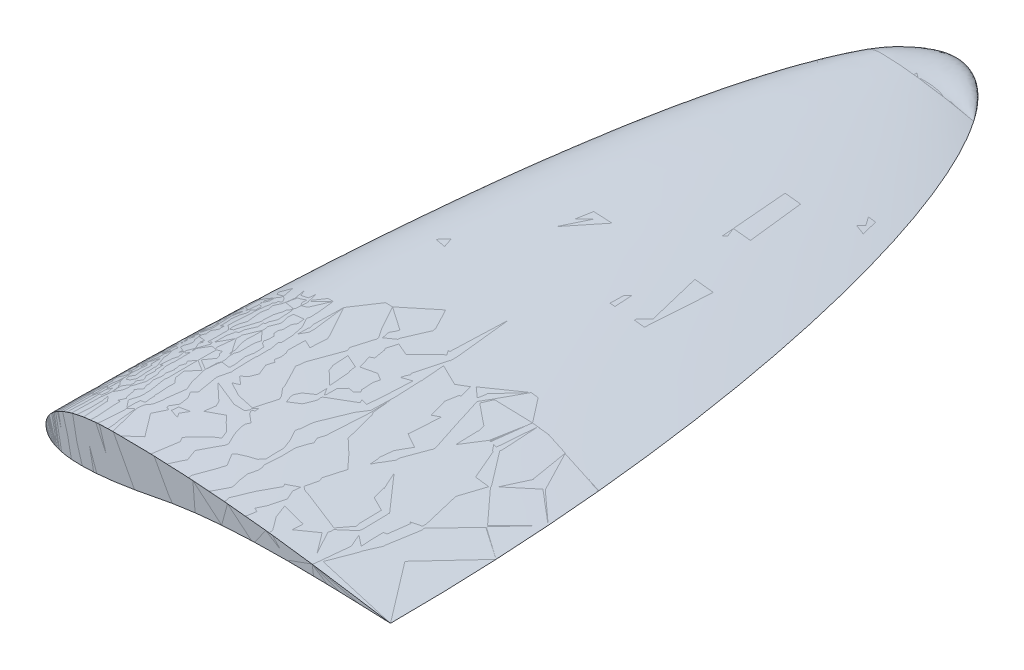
ISO-10303-21;
HEADER;
FILE_DESCRIPTION(('STEP AP214'),'2;1');
FILE_NAME('part.step','',(''),(''),'','','');
FILE_SCHEMA(('AUTOMOTIVE_DESIGN { 1 0 10303 214 1 1 1 1 }'));
ENDSEC;
DATA;
#1=APPLICATION_CONTEXT('core data for automotive mechanical design processes');
#2=APPLICATION_PROTOCOL_DEFINITION('international standard','automotive_design',2000,#1);
#3=PRODUCT_CONTEXT('',#1,'mechanical');
#4=PRODUCT('Part','Part','',(#3));
#5=PRODUCT_RELATED_PRODUCT_CATEGORY('part','',(#4));
#6=PRODUCT_DEFINITION_FORMATION('','',#4);
#7=PRODUCT_DEFINITION_CONTEXT('part definition',#1,'design');
#8=PRODUCT_DEFINITION('design','',#6,#7);
#9=PRODUCT_DEFINITION_SHAPE('','',#8);
#10=(LENGTH_UNIT() NAMED_UNIT(*) SI_UNIT(.MILLI.,.METRE.));
#11=(NAMED_UNIT(*) PLANE_ANGLE_UNIT() SI_UNIT($,.RADIAN.));
#12=(NAMED_UNIT(*) SI_UNIT($,.STERADIAN.) SOLID_ANGLE_UNIT());
#13=UNCERTAINTY_MEASURE_WITH_UNIT(LENGTH_MEASURE(1.E-05),#10,'distance_accuracy_value','');
#14=(GEOMETRIC_REPRESENTATION_CONTEXT(3) GLOBAL_UNCERTAINTY_ASSIGNED_CONTEXT((#13)) GLOBAL_UNIT_ASSIGNED_CONTEXT((#10,
#11,#12)) REPRESENTATION_CONTEXT('',''));
#15=CARTESIAN_POINT('',(0.,0.,0.));
#16=DIRECTION('',(0.,0.,1.));
#17=DIRECTION('',(1.,0.,0.));
#18=AXIS2_PLACEMENT_3D('',#15,#16,#17);
#19=CARTESIAN_POINT('',(-25.2141199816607,0.,-349.999999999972));
#20=CARTESIAN_POINT('',(-25.2141199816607,0.,-349.999999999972));
#21=CARTESIAN_POINT('',(-25.2141199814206,0.,-350.));
#22=CARTESIAN_POINT('',(-25.2141199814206,0.,-350.));
#23=CARTESIAN_POINT('',(-24.7127252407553,0.,-350.928236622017));
#24=CARTESIAN_POINT('',(-24.7127252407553,-0.324320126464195,-350.928236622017));
#25=CARTESIAN_POINT('',(-25.0332844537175,-0.635548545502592,-350.341142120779));
#26=CARTESIAN_POINT('',(-25.2141199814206,-0.708132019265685,-350.));
#27=CARTESIAN_POINT('',(-22.8787992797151,0.,-354.191974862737));
#28=CARTESIAN_POINT('',(-22.8787992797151,-1.4999805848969,-354.191974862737));
#29=CARTESIAN_POINT('',(-23.925728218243,-2.55724657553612,-351.577782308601));
#30=CARTESIAN_POINT('',(-24.7620925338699,-2.89294514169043,-350.000000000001));
#31=CARTESIAN_POINT('',(-18.7003653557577,0.,-360.571998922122));
#32=CARTESIAN_POINT('',(-18.7003653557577,-2.98319558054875,-360.571998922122));
#33=CARTESIAN_POINT('',(-21.1542803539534,-4.51990125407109,-353.84500249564));
#34=CARTESIAN_POINT('',(-20.700974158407,-5.04869093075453,-350.000000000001));
#35=CARTESIAN_POINT('',(-11.0646128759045,0.,-368.705570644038));
#36=CARTESIAN_POINT('',(-11.0646128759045,-4.22733932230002,-368.705570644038));
#37=CARTESIAN_POINT('',(-8.68141922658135,-3.79870684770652,-356.189311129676));
#38=CARTESIAN_POINT('',(-8.34048497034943,-3.31201357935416,-350.));
#39=CARTESIAN_POINT('',(-4.31481570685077,0.,-371.34602082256));
#40=CARTESIAN_POINT('',(-4.31481570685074,-4.60602007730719,-371.34602082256));
#41=CARTESIAN_POINT('',(-3.34642422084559,-2.60125482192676,-356.974367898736));
#42=CARTESIAN_POINT('',(-1.79004023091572,-2.22362414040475,-350.));
#43=CARTESIAN_POINT('',(2.42317448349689,0.,-371.34602082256));
#44=CARTESIAN_POINT('',(2.42317448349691,-4.48280188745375,-371.34602082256));
#45=CARTESIAN_POINT('',(1.7162761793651,-1.69617347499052,-356.667060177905));
#46=CARTESIAN_POINT('',(4.03610241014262,-1.4077280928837,-350.));
#47=CARTESIAN_POINT('',(11.1758084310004,0.,-369.6064603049));
#48=CARTESIAN_POINT('',(11.1758084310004,-3.97271477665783,-369.6064603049));
#49=CARTESIAN_POINT('',(8.26517811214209,-0.693455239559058,-355.504808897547));
#50=CARTESIAN_POINT('',(11.2891593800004,-0.509976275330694,-350.));
#51=CARTESIAN_POINT('',(20.8658247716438,0.,-361.12679066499));
#52=CARTESIAN_POINT('',(20.8658247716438,-2.2769310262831,-361.12679066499));
#53=CARTESIAN_POINT('',(18.7775401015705,-0.208531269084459,-352.853497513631));
#54=CARTESIAN_POINT('',(20.7560863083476,-0.200930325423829,-350.));
#55=CARTESIAN_POINT('',(27.9651666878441,0.,-351.283831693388));
#56=CARTESIAN_POINT('',(27.9651666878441,-0.252992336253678,-351.283831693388));
#57=CARTESIAN_POINT('',(27.7307288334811,-0.0231701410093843,-350.317055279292));
#58=CARTESIAN_POINT('',(27.9505673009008,-0.0223255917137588,-350.));
#59=CARTESIAN_POINT('',(28.8498774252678,0.,-349.999999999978));
#60=CARTESIAN_POINT('',(28.8498774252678,0.,-349.999999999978));
#61=CARTESIAN_POINT('',(28.8498774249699,0.,-350.));
#62=CARTESIAN_POINT('',(28.8498774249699,0.,-350.));
#63=B_SPLINE_SURFACE_WITH_KNOTS('',3,3,((#19,#20,#21,#22),(#23,#24,#25,#26),(#27,#28,#29,#30),
(#31,#32,#33,#34),(#35,#36,#37,#38),(#39,#40,#41,#42),(#43,#44,#45,#46),(#47,#48,#49,#50),(#51,
#52,#53,#54),(#55,#56,#57,#58),(#59,#60,#61,#62)),.UNSPECIFIED.,.F.,.F.,.F.,(4,1,1,1,2,1,1,4),
(4,4),(0.,0.033452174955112,0.121264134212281,0.267617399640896,0.494454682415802,
0.621845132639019,0.952730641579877,1.),(0.,1.),.UNSPECIFIED.);
#64=CARTESIAN_POINT('',(-25.2141199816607,0.,-349.999999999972));
#65=CARTESIAN_POINT('',(-25.0929561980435,0.,-350.224311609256));
#66=CARTESIAN_POINT('',(-24.7286737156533,0.,-350.89235952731));
#67=CARTESIAN_POINT('',(-23.8807800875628,0.,-352.403178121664));
#68=CARTESIAN_POINT('',(-22.6583901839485,0.,-354.4570244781));
#69=CARTESIAN_POINT('',(-20.8411700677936,0.,-357.269315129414));
#70=CARTESIAN_POINT('',(-18.6461218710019,0.,-360.288052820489));
#71=CARTESIAN_POINT('',(-16.9119189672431,0.,-362.309440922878));
#72=CARTESIAN_POINT('',(-14.1675257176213,0.,-365.225859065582));
#73=CARTESIAN_POINT('',(-9.05421179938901,0.,-369.586331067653));
#74=CARTESIAN_POINT('',(-3.57181883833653,0.,-371.34602082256));
#75=CARTESIAN_POINT('',(2.12997873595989,0.,-371.34602082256));
#76=CARTESIAN_POINT('',(10.8415395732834,0.,-369.823369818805));
#77=CARTESIAN_POINT('',(20.539471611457,0.,-361.562181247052));
#78=CARTESIAN_POINT('',(27.9291053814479,0.,-351.336161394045));
#79=CARTESIAN_POINT('',(28.8498774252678,0.,-349.999999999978));
#80=B_SPLINE_CURVE_WITH_KNOTS('',3,(#64,#65,#66,#67,#68,#69,#70,#71,#72,#73,#74,#75,#76,#77,#78,
#79),.UNSPECIFIED.,.F.,.F.,(4,1,1,1,1,1,2,1,2,1,1,4),(0.,0.00808383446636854,0.0242515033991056,
0.0560816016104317,0.0879116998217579,0.140961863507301,0.194012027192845,0.306678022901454,
0.494454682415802,0.606431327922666,0.950803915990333,1.),.UNSPECIFIED.);
#81=CARTESIAN_POINT('',(-25.2141199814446,5.0473104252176E-06,-349.999999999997));
#82=VERTEX_POINT('',#81);
#83=CARTESIAN_POINT('',(28.8498774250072,0.,-349.999999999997));
#84=VERTEX_POINT('',#83);
#85=EDGE_CURVE('E520',#82,#84,#80,.T.);
#86=CARTESIAN_POINT('',(-25.2141199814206,0.,-350.));
#87=CARTESIAN_POINT('',(-25.2141199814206,-5.66505615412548,-350.));
#88=CARTESIAN_POINT('',(-6.67006687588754,-3.15055622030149,-350.));
#89=CARTESIAN_POINT('',(7.72165353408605,-0.524513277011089,-350.));
#90=CARTESIAN_POINT('',(21.6553964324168,-0.17860473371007,-350.));
#91=CARTESIAN_POINT('',(28.8498774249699,0.,-350.));
#92=B_SPLINE_CURVE_WITH_KNOTS('',3,(#86,#87,#88,#89,#90,#91),.UNSPECIFIED.,.F.,.F.,(4,1,1,4),
(0.,0.267617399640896,0.621845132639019,1.),.UNSPECIFIED.);
#93=EDGE_CURVE('E536',#82,#84,#92,.T.);
#94=ORIENTED_EDGE('',*,*,#85,.T.);
#95=ORIENTED_EDGE('',*,*,#93,.F.);
#96=EDGE_LOOP('',(#94,#95));
#97=FACE_BOUND('',#96,.T.);
#98=ADVANCED_FACE('F491',(#97),#63,.T.);
#99=CARTESIAN_POINT('',(-25.2141199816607,0.,-349.999999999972));
#100=CARTESIAN_POINT('',(-25.2141199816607,0.,-349.999999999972));
#101=CARTESIAN_POINT('',(-25.2141199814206,0.,-350.));
#102=CARTESIAN_POINT('',(-25.2141199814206,0.,-350.));
#103=CARTESIAN_POINT('',(-25.0929561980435,0.,-350.224311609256));
#104=CARTESIAN_POINT('',(-25.0929561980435,0.0818819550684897,-350.224311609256));
#105=CARTESIAN_POINT('',(-25.1693316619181,0.162842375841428,-350.082941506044));
#106=CARTESIAN_POINT('',(-25.2141199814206,0.165678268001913,-350.));
#107=CARTESIAN_POINT('',(-24.7286737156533,0.,-350.89235952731));
#108=CARTESIAN_POINT('',(-24.7286737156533,0.327527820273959,-350.89235952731));
#109=CARTESIAN_POINT('',(-25.0090614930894,0.641837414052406,-350.331766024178));
#110=CARTESIAN_POINT('',(-25.1882147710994,0.653180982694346,-350.));
#111=CARTESIAN_POINT('',(-23.8807800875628,0.,-352.403178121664));
#112=CARTESIAN_POINT('',(-23.8807800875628,0.855866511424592,-352.403178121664));
#113=CARTESIAN_POINT('',(-24.5051802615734,1.56758048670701,-350.893644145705));
#114=CARTESIAN_POINT('',(-24.9574006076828,1.71392645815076,-350.));
#115=CARTESIAN_POINT('',(-22.6583901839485,0.,-354.4570244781));
#116=CARTESIAN_POINT('',(-22.6583901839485,1.5247620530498,-354.4570244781));
#117=CARTESIAN_POINT('',(-23.6144827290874,2.55317461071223,-351.681522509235));
#118=CARTESIAN_POINT('',(-24.1970060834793,3.03349841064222,-350.));
#119=CARTESIAN_POINT('',(-20.8411700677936,0.,-357.269315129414));
#120=CARTESIAN_POINT('',(-20.8411700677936,2.35518177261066,-357.269315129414));
#121=CARTESIAN_POINT('',(-22.051660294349,3.84490452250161,-352.744958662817));
#122=CARTESIAN_POINT('',(-22.4373715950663,4.58346709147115,-350.));
#123=CARTESIAN_POINT('',(-18.6461218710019,0.,-360.288052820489));
#124=CARTESIAN_POINT('',(-18.6461218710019,3.14422356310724,-360.288052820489));
#125=CARTESIAN_POINT('',(-19.593053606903,5.10499857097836,-353.808088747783));
#126=CARTESIAN_POINT('',(-19.6354182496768,5.80147363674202,-350.));
#127=CARTESIAN_POINT('',(-16.9119189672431,0.,-362.309440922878));
#128=CARTESIAN_POINT('',(-16.9119189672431,3.55320570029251,-362.309440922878));
#129=CARTESIAN_POINT('',(-17.4313381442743,5.72322212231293,-354.42569181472));
#130=CARTESIAN_POINT('',(-17.2639571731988,6.12239571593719,-350.));
#131=CARTESIAN_POINT('',(-14.1675257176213,0.,-365.225859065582));
#132=CARTESIAN_POINT('',(-14.1675257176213,4.11910298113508,-365.225859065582));
#133=CARTESIAN_POINT('',(-14.2251316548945,5.98683937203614,-355.323075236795));
#134=CARTESIAN_POINT('',(-13.7649160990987,6.1223957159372,-350.));
#135=CARTESIAN_POINT('',(-9.05421179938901,0.,-369.586331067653));
#136=CARTESIAN_POINT('',(-9.05421179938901,4.86443992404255,-369.586331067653));
#137=CARTESIAN_POINT('',(-8.51101144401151,5.49008471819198,-356.691130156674));
#138=CARTESIAN_POINT('',(-7.65373959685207,5.92059918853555,-350.));
#139=CARTESIAN_POINT('',(-3.57181883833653,0.,-371.34602082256));
#140=CARTESIAN_POINT('',(-3.57181883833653,5.11472578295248,-371.34602082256));
#141=CARTESIAN_POINT('',(-3.7799723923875,5.0743844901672,-357.051321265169));
#142=CARTESIAN_POINT('',(-2.08240653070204,5.32552117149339,-350.));
#143=CARTESIAN_POINT('',(2.12997873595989,0.,-371.34602082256));
#144=CARTESIAN_POINT('',(2.12997873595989,4.99477042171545,-371.34602082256));
#145=CARTESIAN_POINT('',(0.915683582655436,4.4858042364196,-356.753122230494));
#146=CARTESIAN_POINT('',(3.22301231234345,4.63710308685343,-350.));
#147=CARTESIAN_POINT('',(10.8415395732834,0.,-369.823369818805));
#148=CARTESIAN_POINT('',(10.8415395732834,4.47654238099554,-369.823369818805));
#149=CARTESIAN_POINT('',(8.04215750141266,3.43192333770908,-355.702163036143));
#150=CARTESIAN_POINT('',(11.0702592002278,3.50306502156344,-350.));
#151=CARTESIAN_POINT('',(20.539471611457,0.,-361.562181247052));
#152=CARTESIAN_POINT('',(20.539471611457,2.70721271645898,-361.562181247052));
#153=CARTESIAN_POINT('',(16.9088838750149,2.24402628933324,-352.925945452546));
#154=CARTESIAN_POINT('',(18.9300290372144,2.22652920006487,-350.));
#155=CARTESIAN_POINT('',(27.9291053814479,0.,-351.336161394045));
#156=CARTESIAN_POINT('',(27.9291053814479,0.300801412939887,-351.336161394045));
#157=CARTESIAN_POINT('',(27.4798389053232,0.264705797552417,-350.325105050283));
#158=CARTESIAN_POINT('',(27.7044105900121,0.262761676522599,-350.));
#159=CARTESIAN_POINT('',(28.8498774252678,0.,-349.999999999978));
#160=CARTESIAN_POINT('',(28.8498774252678,0.,-349.999999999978));
#161=CARTESIAN_POINT('',(28.8498774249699,0.,-350.));
#162=CARTESIAN_POINT('',(28.8498774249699,0.,-350.));
#163=B_SPLINE_SURFACE_WITH_KNOTS('',3,3,((#99,#100,#101,#102),(#103,#104,#105,#106),(#107,#108,
#109,#110),(#111,#112,#113,#114),(#115,#116,#117,#118),(#119,#120,#121,#122),(#123,#124,#125,
#126),(#127,#128,#129,#130),(#131,#132,#133,#134),(#135,#136,#137,#138),(#139,#140,#141,#142),
(#143,#144,#145,#146),(#147,#148,#149,#150),(#151,#152,#153,#154),(#155,#156,#157,#158),(#159,
#160,#161,#162)),.UNSPECIFIED.,.F.,.F.,.F.,(4,1,1,1,1,1,2,1,2,1,1,4),(4,4),(0.,
0.00808383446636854,0.0242515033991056,0.0560816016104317,0.0879116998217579,0.140961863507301,
0.194012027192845,0.306678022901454,0.494454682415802,0.606431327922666,0.950803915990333,1.),
(0.,1.),.UNSPECIFIED.);
#164=CARTESIAN_POINT('',(28.8498774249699,0.,-350.));
#165=CARTESIAN_POINT('',(19.686142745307,2.10209341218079,-350.));
#166=CARTESIAN_POINT('',(7.29860078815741,4.14074649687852,-350.));
#167=CARTESIAN_POINT('',(-7.43572569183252,6.1223957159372,-350.));
#168=CARTESIAN_POINT('',(-20.2403195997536,6.12239571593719,-350.));
#169=CARTESIAN_POINT('',(-25.2141199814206,3.97627843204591,-350.));
#170=CARTESIAN_POINT('',(-25.2141199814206,0.,-350.));
#171=B_SPLINE_CURVE_WITH_KNOTS('',3,(#164,#165,#166,#167,#168,#169,#170),.UNSPECIFIED.,.F.,.F.,
(4,1,2,4),(0.,0.393568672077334,0.805987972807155,1.),.UNSPECIFIED.);
#172=EDGE_CURVE('E15',#84,#82,#171,.T.);
#173=ORIENTED_EDGE('',*,*,#85,.F.);
#174=ORIENTED_EDGE('',*,*,#172,.F.);
#175=EDGE_LOOP('',(#173,#174));
#176=FACE_BOUND('',#175,.T.);
#177=ADVANCED_FACE('F597',(#176),#163,.F.);
#178=CARTESIAN_POINT('',(97.8465587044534,0.,0.));
#179=CARTESIAN_POINT('',(97.8465587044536,0.,-150.332791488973));
#180=CARTESIAN_POINT('',(65.6958874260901,0.,-296.531591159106));
#181=CARTESIAN_POINT('',(28.8498774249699,0.,-350.));
#182=CARTESIAN_POINT('',(94.2929233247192,0.137056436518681,0.));
#183=CARTESIAN_POINT('',(94.2929233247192,0.137056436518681,-150.331477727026));
#184=CARTESIAN_POINT('',(63.327423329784,0.0538404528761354,-296.530934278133));
#185=CARTESIAN_POINT('',(27.6665846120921,-0.0293755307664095,-350.));
#186=CARTESIAN_POINT('',(87.1837945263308,0.411250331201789,0.));
#187=CARTESIAN_POINT('',(87.1837945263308,0.411250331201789,-149.817989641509));
#188=CARTESIAN_POINT('',(58.5123374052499,0.161576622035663,-296.277695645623));
#189=CARTESIAN_POINT('',(25.3006395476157,-0.0880971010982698,-350.));
#190=CARTESIAN_POINT('',(76.5137997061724,0.786757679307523,0.));
#191=CARTESIAN_POINT('',(76.5137997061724,0.786757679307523,-149.51253316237));
#192=CARTESIAN_POINT('',(51.0839596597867,0.299349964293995,-296.139427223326));
#193=CARTESIAN_POINT('',(21.7536580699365,-0.188057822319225,-350.));
#194=CARTESIAN_POINT('',(65.8371932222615,1.08942831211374,0.));
#195=CARTESIAN_POINT('',(65.8371932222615,1.08942831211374,-149.137865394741));
#196=CARTESIAN_POINT('',(43.4788740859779,0.388512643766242,-295.974440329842));
#197=CARTESIAN_POINT('',(18.2088430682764,-0.312403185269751,-350.));
#198=CARTESIAN_POINT('',(55.154363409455,1.28007634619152,0.));
#199=CARTESIAN_POINT('',(55.154363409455,1.28007634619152,-148.838279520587));
#200=CARTESIAN_POINT('',(35.7266245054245,0.402119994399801,-295.853567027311));
#201=CARTESIAN_POINT('',(14.6667321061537,-0.475836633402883,-350.));
#202=CARTESIAN_POINT('',(46.2481391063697,1.31031842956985,0.));
#203=CARTESIAN_POINT('',(46.2481391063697,1.31031842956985,-148.61968636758));
#204=CARTESIAN_POINT('',(29.1691763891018,0.325828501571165,-295.772751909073));
#205=CARTESIAN_POINT('',(11.7182313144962,-0.658661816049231,-349.999999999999));
#206=CARTESIAN_POINT('',(39.1226024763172,1.23388095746,0.));
#207=CARTESIAN_POINT('',(39.1226024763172,1.23388095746,-148.469453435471));
#208=CARTESIAN_POINT('',(23.8809039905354,0.194532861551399,-295.722392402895));
#209=CARTESIAN_POINT('',(9.3626026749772,-0.844815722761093,-350.));
#210=CARTESIAN_POINT('',(33.7789290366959,1.11968886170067,0.));
#211=CARTESIAN_POINT('',(33.7789290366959,1.11968886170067,-148.368273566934));
#212=CARTESIAN_POINT('',(19.897856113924,0.0559494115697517,-295.691191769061));
#213=CARTESIAN_POINT('',(7.59806609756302,-1.00779060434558,-350.));
#214=CARTESIAN_POINT('',(28.4365962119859,0.941960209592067,0.));
#215=CARTESIAN_POINT('',(28.4365962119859,0.941960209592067,-148.278928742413));
#216=CARTESIAN_POINT('',(15.9023300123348,-0.127788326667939,-295.666565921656));
#217=CARTESIAN_POINT('',(5.83631332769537,-1.19753750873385,-350.));
#218=CARTESIAN_POINT('',(23.0968238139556,0.693227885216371,0.));
#219=CARTESIAN_POINT('',(23.0968238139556,0.693227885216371,-148.201445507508));
#220=CARTESIAN_POINT('',(11.8985726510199,-0.358949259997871,-295.648363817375));
#221=CARTESIAN_POINT('',(4.07734826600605,-1.41112713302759,-350.));
#222=CARTESIAN_POINT('',(17.7610616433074,0.36594440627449,0.));
#223=CARTESIAN_POINT('',(17.7610616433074,0.36594440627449,-148.135923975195));
#224=CARTESIAN_POINT('',(7.89094598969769,-0.639842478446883,-295.636471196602));
#225=CARTESIAN_POINT('',(2.32117481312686,-1.64563017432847,-350.));
#226=CARTESIAN_POINT('',(12.4312841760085,-0.0487740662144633,0.));
#227=CARTESIAN_POINT('',(12.4312841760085,-0.0487740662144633,-148.082436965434));
#228=CARTESIAN_POINT('',(3.88378137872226,-0.972412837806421,-295.630760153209));
#229=CARTESIAN_POINT('',(0.56721097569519,-1.89605250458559,-350.));
#230=CARTESIAN_POINT('',(7.10973007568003,-0.559123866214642,0.));
#231=CARTESIAN_POINT('',(7.10973007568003,-0.559123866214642,-148.041049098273));
#232=CARTESIAN_POINT('',(-0.118457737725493,-1.35826144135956,-295.631098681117));
#233=CARTESIAN_POINT('',(-1.18512523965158,-2.15739999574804,-350.));
#234=CARTESIAN_POINT('',(1.79959444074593,-1.17633812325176,0.));
#235=CARTESIAN_POINT('',(1.79959444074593,-1.17633812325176,-148.011814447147));
#236=CARTESIAN_POINT('',(-4.11083817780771,-1.80108512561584,-295.637349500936));
#237=CARTESIAN_POINT('',(-2.93643278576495,-2.42583319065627,-350.));
#238=CARTESIAN_POINT('',(-3.49585826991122,-1.9083718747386,0.));
#239=CARTESIAN_POINT('',(-3.49585826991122,-1.9083718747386,-147.994780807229));
#240=CARTESIAN_POINT('',(-8.08839207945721,-2.30294168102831,-295.649372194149));
#241=CARTESIAN_POINT('',(-4.68731061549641,-2.6975126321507,-350.));
#242=CARTESIAN_POINT('',(-8.7713003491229,-2.77171700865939,0.));
#243=CARTESIAN_POINT('',(-8.7713003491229,-2.77171700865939,-147.989987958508));
#244=CARTESIAN_POINT('',(-12.0450893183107,-2.87034640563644,-295.667022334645));
#245=CARTESIAN_POINT('',(-6.43829640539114,-2.96897702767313,-350.));
#246=CARTESIAN_POINT('',(-14.0239679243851,-3.76122133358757,0.));
#247=CARTESIAN_POINT('',(-14.0239679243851,-3.76122133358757,-147.997489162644));
#248=CARTESIAN_POINT('',(-15.9761816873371,-3.4989925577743,-295.690162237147));
#249=CARTESIAN_POINT('',(-8.18992783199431,-3.23676508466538,-350.));
#250=CARTESIAN_POINT('',(-19.268945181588,-4.78668093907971,0.));
#251=CARTESIAN_POINT('',(-19.268945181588,-4.78668093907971,-148.017387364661));
#252=CARTESIAN_POINT('',(-19.8855418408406,-4.14430403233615,-295.718679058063));
#253=CARTESIAN_POINT('',(-9.94213623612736,-3.50192850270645,-350.));
#254=CARTESIAN_POINT('',(-24.5204830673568,-5.77651610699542,0.));
#255=CARTESIAN_POINT('',(-24.5204830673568,-5.77651610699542,-148.049759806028));
#256=CARTESIAN_POINT('',(-23.7766258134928,-4.77101682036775,-295.752447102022));
#257=CARTESIAN_POINT('',(-11.6948529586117,-3.76551898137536,-350.));
#258=CARTESIAN_POINT('',(-29.7892675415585,-6.66714979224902,0.));
#259=CARTESIAN_POINT('',(-29.7892675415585,-6.66714979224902,-148.094647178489));
#260=CARTESIAN_POINT('',(-27.6521966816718,-5.33944408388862,-295.79132239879));
#261=CARTESIAN_POINT('',(-13.4501884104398,-4.01173988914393,-350.));
#262=CARTESIAN_POINT('',(-35.078605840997,-7.42317828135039,0.));
#263=CARTESIAN_POINT('',(-35.078605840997,-7.42317828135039,-148.15204517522));
#264=CARTESIAN_POINT('',(-31.5113281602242,-5.82398565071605,-295.83513847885));
#265=CARTESIAN_POINT('',(-15.2102530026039,-4.22479459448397,-350.));
#266=CARTESIAN_POINT('',(-40.3874279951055,-8.02029313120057,0.));
#267=CARTESIAN_POINT('',(-40.3874279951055,-8.02029313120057,-148.221930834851));
#268=CARTESIAN_POINT('',(-35.351149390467,-6.19666342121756,-295.883719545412));
#269=CARTESIAN_POINT('',(-16.9776452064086,-4.37303534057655,-350.));
#270=CARTESIAN_POINT('',(-45.7103676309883,-8.46467192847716,0.));
#271=CARTESIAN_POINT('',(-45.7103676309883,-8.46467192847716,-148.304372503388));
#272=CARTESIAN_POINT('',(-39.1645830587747,-6.445794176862,-295.936935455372));
#273=CARTESIAN_POINT('',(-18.7508469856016,-4.42691810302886,-349.999999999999));
#274=CARTESIAN_POINT('',(-50.1588462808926,-8.63727061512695,0.));
#275=CARTESIAN_POINT('',(-50.1588462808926,-8.63727061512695,-148.383612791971));
#276=CARTESIAN_POINT('',(-42.3157613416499,-6.49281423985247,-295.985045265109));
#277=CARTESIAN_POINT('',(-20.2290969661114,-4.34835957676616,-350.000000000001));
#278=CARTESIAN_POINT('',(-53.7187394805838,-8.57591376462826,0.));
#279=CARTESIAN_POINT('',(-53.7187394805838,-8.57591376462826,-148.453456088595));
#280=CARTESIAN_POINT('',(-44.8088319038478,-6.37014714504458,-296.025772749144));
#281=CARTESIAN_POINT('',(-21.3984638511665,-4.16438226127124,-349.999999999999));
#282=CARTESIAN_POINT('',(-56.383145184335,-8.3987838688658,0.));
#283=CARTESIAN_POINT('',(-56.383145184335,-8.3987838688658,-148.509167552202));
#284=CARTESIAN_POINT('',(-46.6563565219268,-6.17181033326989,-296.057469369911));
#285=CARTESIAN_POINT('',(-22.2591660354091,-3.94483854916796,-350.));
#286=CARTESIAN_POINT('',(-59.0304397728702,-8.04491120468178,0.));
#287=CARTESIAN_POINT('',(-59.0304397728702,-8.04491120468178,-148.568347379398));
#288=CARTESIAN_POINT('',(-48.4669364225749,-5.83177183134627,-296.09036614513));
#289=CARTESIAN_POINT('',(-23.0867181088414,-3.61863422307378,-350.));
#290=CARTESIAN_POINT('',(-61.2010148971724,-7.54353155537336,0.));
#291=CARTESIAN_POINT('',(-61.2010148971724,-7.54353155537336,-148.620739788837));
#292=CARTESIAN_POINT('',(-49.9199339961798,-5.38723317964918,-296.11885592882));
#293=CARTESIAN_POINT('',(-23.7206580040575,-3.23093657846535,-350.));
#294=CARTESIAN_POINT('',(-62.8831141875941,-6.95888112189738,0.));
#295=CARTESIAN_POINT('',(-62.8831141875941,-6.95888112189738,-148.664237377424));
#296=CARTESIAN_POINT('',(-51.0177963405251,-4.89900057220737,-296.142152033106));
#297=CARTESIAN_POINT('',(-24.1658221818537,-2.83912180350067,-350.));
#298=CARTESIAN_POINT('',(-64.0990524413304,-6.40588436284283,0.));
#299=CARTESIAN_POINT('',(-64.0990524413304,-6.40588436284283,-148.69720742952));
#300=CARTESIAN_POINT('',(-51.795558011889,-4.45615467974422,-296.159651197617));
#301=CARTESIAN_POINT('',(-24.4605363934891,-2.50642678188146,-350.));
#302=CARTESIAN_POINT('',(-65.2430579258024,-5.71382144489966,0.));
#303=CARTESIAN_POINT('',(-65.2430579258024,-5.71382144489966,-148.729770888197));
#304=CARTESIAN_POINT('',(-52.5103969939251,-3.92535593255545,-296.176798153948));
#305=CARTESIAN_POINT('',(-24.7079266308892,-2.1368922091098,-350.));
#306=CARTESIAN_POINT('',(-66.2714959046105,-4.85681986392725,0.));
#307=CARTESIAN_POINT('',(-66.2714959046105,-4.85681986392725,-148.760245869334));
#308=CARTESIAN_POINT('',(-53.1392492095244,-3.2975774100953,-296.192749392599));
#309=CARTESIAN_POINT('',(-24.9056130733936,-1.73833674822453,-350.));
#310=CARTESIAN_POINT('',(-67.1242682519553,-3.82208794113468,0.));
#311=CARTESIAN_POINT('',(-67.1242682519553,-3.82208794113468,-148.786309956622));
#312=CARTESIAN_POINT('',(-53.6508188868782,-2.57033260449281,-296.206341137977));
#313=CARTESIAN_POINT('',(-25.051215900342,-1.31857906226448,-350.));
#314=CARTESIAN_POINT('',(-67.7387550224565,-2.62915272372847,0.));
#315=CARTESIAN_POINT('',(-67.7387550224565,-2.62915272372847,-148.805312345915));
#316=CARTESIAN_POINT('',(-54.0158784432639,-1.75695176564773,-296.21624542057));
#317=CARTESIAN_POINT('',(-25.1490134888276,-0.884752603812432,-350.));
#318=CARTESIAN_POINT('',(-68.0861057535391,-1.33424241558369,0.));
#319=CARTESIAN_POINT('',(-68.0861057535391,-1.33424241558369,-148.815992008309));
#320=CARTESIAN_POINT('',(-54.2220850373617,-0.889115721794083,-296.221829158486));
#321=CARTESIAN_POINT('',(-25.2032842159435,-0.443990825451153,-350.));
#322=CARTESIAN_POINT('',(-68.1532388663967,-0.444534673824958,0.));
#323=CARTESIAN_POINT('',(-68.1532388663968,-0.444534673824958,-148.817976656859));
#324=CARTESIAN_POINT('',(-54.2622811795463,-0.296245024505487,-296.222876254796));
#325=CARTESIAN_POINT('',(-25.2141199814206,-0.147957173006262,-350.));
#326=CARTESIAN_POINT('',(-68.1532388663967,-1.18925193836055E-05,0.));
#327=CARTESIAN_POINT('',(-68.1532388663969,-1.18925193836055E-05,-148.817976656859));
#328=CARTESIAN_POINT('',(-54.2622811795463,0.,-296.222876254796));
#329=CARTESIAN_POINT('',(-25.2141199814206,1.00946208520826E-05,-350.));
#330=B_SPLINE_SURFACE_WITH_KNOTS('',3,3,((#178,#179,#180,#181),(#182,#183,#184,#185),(#186,#187,
#188,#189),(#190,#191,#192,#193),(#194,#195,#196,#197),(#198,#199,#200,#201),(#202,#203,#204,
#205),(#206,#207,#208,#209),(#210,#211,#212,#213),(#214,#215,#216,#217),(#218,#219,#220,#221),
(#222,#223,#224,#225),(#226,#227,#228,#229),(#230,#231,#232,#233),(#234,#235,#236,#237),(#238,
#239,#240,#241),(#242,#243,#244,#245),(#246,#247,#248,#249),(#250,#251,#252,#253),(#254,#255,
#256,#257),(#258,#259,#260,#261),(#262,#263,#264,#265),(#266,#267,#268,#269),(#270,#271,#272,
#273),(#274,#275,#276,#277),(#278,#279,#280,#281),(#282,#283,#284,#285),(#286,#287,#288,#289),
(#290,#291,#292,#293),(#294,#295,#296,#297),(#298,#299,#300,#301),(#302,#303,#304,#305),(#306,
#307,#308,#309),(#310,#311,#312,#313),(#314,#315,#316,#317),(#318,#319,#320,#321),(#322,#323,
#324,#325),(#326,#327,#328,#329)),.UNSPECIFIED.,.F.,.F.,.F.,(4,1,1,1,1,1,1,1,1,1,1,1,1,1,1,1,1,
1,1,1,1,1,1,1,1,1,1,1,1,1,1,1,1,1,1,4),(4,4),(0.,0.0310723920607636,0.0621447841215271,
0.0932171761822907,0.124289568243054,0.155361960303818,0.1708981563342,0.186434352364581,
0.201970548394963,0.217506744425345,0.233042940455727,0.248579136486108,0.26411533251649,
0.279651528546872,0.295187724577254,0.310723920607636,0.326260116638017,0.341796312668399,
0.357332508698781,0.372868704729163,0.388404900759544,0.403941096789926,0.419477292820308,
0.43501348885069,0.442781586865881,0.450549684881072,0.458317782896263,0.466085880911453,
0.469969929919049,0.473853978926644,0.47773802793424,0.481622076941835,0.485506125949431,
0.489390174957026,0.493274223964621,0.497158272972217),(0.,1.),.UNSPECIFIED.);
#331=CARTESIAN_POINT('',(-68.1532388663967,-1.18925193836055E-05,0.));
#332=CARTESIAN_POINT('',(-68.1532385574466,-0.119486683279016,0.));
#333=CARTESIAN_POINT('',(-68.1508142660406,-0.23897559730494,0.));
#334=CARTESIAN_POINT('',(-68.1408176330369,-0.477874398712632,0.));
#335=CARTESIAN_POINT('',(-68.1332393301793,-0.59728403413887,0.));
#336=CARTESIAN_POINT('',(-68.1126298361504,-0.835678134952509,0.));
#337=CARTESIAN_POINT('',(-68.0995968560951,-0.954662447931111,0.));
#338=CARTESIAN_POINT('',(-68.0677234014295,-1.1922535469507,0.));
#339=CARTESIAN_POINT('',(-68.0488639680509,-1.31085780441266,0.));
#340=CARTESIAN_POINT('',(-68.0051130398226,-1.54691569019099,0.));
#341=CARTESIAN_POINT('',(-67.9802234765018,-1.66436967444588,0.));
#342=CARTESIAN_POINT('',(-67.9242892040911,-1.8977826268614,0.));
#343=CARTESIAN_POINT('',(-67.8932452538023,-2.01374177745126,0.));
#344=CARTESIAN_POINT('',(-67.8082566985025,-2.29957764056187,0.));
#345=CARTESIAN_POINT('',(-67.7505054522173,-2.46834524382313,0.));
#346=CARTESIAN_POINT('',(-67.6207228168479,-2.8002993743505,0.));
#347=CARTESIAN_POINT('',(-67.548690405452,-2.96348550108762,0.));
#348=CARTESIAN_POINT('',(-67.3911663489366,-3.28275167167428,0.));
#349=CARTESIAN_POINT('',(-67.305708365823,-3.43884826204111,0.));
#350=CARTESIAN_POINT('',(-67.1677952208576,-3.66706111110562,0.));
#351=CARTESIAN_POINT('',(-67.1201976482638,-3.74215094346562,0.));
#352=CARTESIAN_POINT('',(-67.0218326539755,-3.89022532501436,0.));
#353=CARTESIAN_POINT('',(-66.9710652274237,-3.96320987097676,0.));
#354=CARTESIAN_POINT('',(-66.8146257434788,-4.17842992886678,0.));
#355=CARTESIAN_POINT('',(-66.7044977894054,-4.31745668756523,0.));
#356=CARTESIAN_POINT('',(-66.4737282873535,-4.58643587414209,0.));
#357=CARTESIAN_POINT('',(-66.3530866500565,-4.71638822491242,0.));
#358=CARTESIAN_POINT('',(-66.1022936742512,-4.96714265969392,0.));
#359=CARTESIAN_POINT('',(-65.9721283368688,-5.08793071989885,0.));
#360=CARTESIAN_POINT('',(-65.7038547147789,-5.32030259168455,0.));
#361=CARTESIAN_POINT('',(-65.5657454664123,-5.43188528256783,0.));
#362=CARTESIAN_POINT('',(-65.1906775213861,-5.71592116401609,0.));
#363=CARTESIAN_POINT('',(-64.9478823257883,-5.88072923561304,0.));
#364=CARTESIAN_POINT('',(-64.5735530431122,-6.11123407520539,0.));
#365=CARTESIAN_POINT('',(-64.4470300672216,-6.18531300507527,0.));
#366=CARTESIAN_POINT('',(-64.1910704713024,-6.32826216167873,0.));
#367=CARTESIAN_POINT('',(-64.0616339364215,-6.39713254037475,0.));
#368=CARTESIAN_POINT('',(-63.6689814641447,-6.59668035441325,0.));
#369=CARTESIAN_POINT('',(-63.4019847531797,-6.71995346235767,0.));
#370=CARTESIAN_POINT('',(-62.8607585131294,-6.94903538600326,0.));
#371=CARTESIAN_POINT('',(-62.586530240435,-7.05484721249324,0.));
#372=CARTESIAN_POINT('',(-62.0722564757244,-7.23730144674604,0.));
#373=CARTESIAN_POINT('',(-61.8329159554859,-7.31595168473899,0.));
#374=CARTESIAN_POINT('',(-61.3512332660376,-7.46351099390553,0.));
#375=CARTESIAN_POINT('',(-61.1088907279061,-7.53241885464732,0.));
#376=CARTESIAN_POINT('',(-60.6215090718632,-7.66143414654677,0.));
#377=CARTESIAN_POINT('',(-60.3764665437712,-7.72152862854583,0.));
#378=CARTESIAN_POINT('',(-59.8845725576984,-7.83369505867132,0.));
#379=CARTESIAN_POINT('',(-59.6377211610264,-7.88576727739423,0.));
#380=CARTESIAN_POINT('',(-59.1424888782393,-7.98288794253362,0.));
#381=CARTESIAN_POINT('',(-58.8941071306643,-8.02793196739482,0.));
#382=CARTESIAN_POINT('',(-58.3962816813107,-8.11168108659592,0.));
#383=CARTESIAN_POINT('',(-58.1468379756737,-8.1503861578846,0.));
#384=CARTESIAN_POINT('',(-57.6458110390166,-8.22213753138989,0.));
#385=CARTESIAN_POINT('',(-57.3942234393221,-8.25515320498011,0.));
#386=CARTESIAN_POINT('',(-56.8904111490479,-8.31584005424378,0.));
#387=CARTESIAN_POINT('',(-56.6381864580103,-8.34351122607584,0.));
#388=CARTESIAN_POINT('',(-55.8813042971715,-8.41927739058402,0.));
#389=CARTESIAN_POINT('',(-55.3759191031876,-8.46019706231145,0.));
#390=CARTESIAN_POINT('',(-54.36423638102,-8.5257392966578,0.));
#391=CARTESIAN_POINT('',(-53.8579390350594,-8.55036481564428,0.));
#392=CARTESIAN_POINT('',(-52.5435246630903,-8.59655306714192,0.));
#393=CARTESIAN_POINT('',(-51.7350383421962,-8.60757846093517,0.));
#394=CARTESIAN_POINT('',(-50.1181078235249,-8.6024842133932,0.));
#395=CARTESIAN_POINT('',(-49.3096636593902,-8.58635969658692,0.));
#396=CARTESIAN_POINT('',(-47.6922772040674,-8.53191927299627,0.));
#397=CARTESIAN_POINT('',(-46.8833361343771,-8.49356844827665,0.));
#398=CARTESIAN_POINT('',(-45.6707269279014,-8.42325684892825,0.));
#399=CARTESIAN_POINT('',(-45.2666663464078,-8.39768944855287,0.));
#400=CARTESIAN_POINT('',(-44.4588055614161,-8.34271312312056,0.));
#401=CARTESIAN_POINT('',(-44.0550053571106,-8.31330421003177,0.));
#402=CARTESIAN_POINT('',(-43.2470978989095,-8.25091300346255,0.));
#403=CARTESIAN_POINT('',(-42.842991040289,-8.21792562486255,0.));
#404=CARTESIAN_POINT('',(-42.0350518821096,-8.14874531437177,0.));
#405=CARTESIAN_POINT('',(-41.6312195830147,-8.112552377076,0.));
#406=CARTESIAN_POINT('',(-40.8238176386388,-8.03731613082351,0.));
#407=CARTESIAN_POINT('',(-40.4202479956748,-7.99827279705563,0.));
#408=CARTESIAN_POINT('',(-39.6133718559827,-7.91756894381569,0.));
#409=CARTESIAN_POINT('',(-39.2100653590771,-7.87590842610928,0.));
#410=CARTESIAN_POINT('',(-38.0008815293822,-7.74694539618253,0.));
#411=CARTESIAN_POINT('',(-37.1954262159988,-7.65563216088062,0.));
#412=CARTESIAN_POINT('',(-35.9882349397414,-7.51052296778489,0.));
#413=CARTESIAN_POINT('',(-35.5860046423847,-7.46079688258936,0.));
#414=CARTESIAN_POINT('',(-34.7818925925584,-7.35859909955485,0.));
#415=CARTESIAN_POINT('',(-34.3800108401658,-7.30612740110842,0.));
#416=CARTESIAN_POINT('',(-33.1726094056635,-7.14442500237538,0.));
#417=CARTESIAN_POINT('',(-32.3676242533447,-7.03118298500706,0.));
#418=CARTESIAN_POINT('',(-30.7591122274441,-6.79477587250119,0.));
#419=CARTESIAN_POINT('',(-29.955585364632,-6.67161070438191,0.));
#420=CARTESIAN_POINT('',(-28.3510345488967,-6.4163807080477,0.));
#421=CARTESIAN_POINT('',(-27.5500086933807,-6.28432781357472,0.));
#422=CARTESIAN_POINT('',(-25.9493060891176,-6.01231918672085,0.));
#423=CARTESIAN_POINT('',(-25.14962933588,-5.87236348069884,0.));
#424=CARTESIAN_POINT('',(-22.7530170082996,-5.44250228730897,0.));
#425=CARTESIAN_POINT('',(-21.1579006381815,-5.14250571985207,0.));
#426=CARTESIAN_POINT('',(-18.7666573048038,-4.68435696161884,0.));
#427=CARTESIAN_POINT('',(-17.9697288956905,-4.53026467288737,0.));
#428=CARTESIAN_POINT('',(-16.3759600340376,-4.22160406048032,0.));
#429=CARTESIAN_POINT('',(-15.5791195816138,-4.06703573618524,0.));
#430=CARTESIAN_POINT('',(-14.0175148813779,-3.76588597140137,0.));
#431=CARTESIAN_POINT('',(-13.2527639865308,-3.61923535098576,0.));
#432=CARTESIAN_POINT('',(-11.7225133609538,-3.32988046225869,0.));
#433=CARTESIAN_POINT('',(-10.957013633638,-3.18717617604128,0.));
#434=CARTESIAN_POINT('',(-9.80788710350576,-2.97797785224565,0.));
#435=CARTESIAN_POINT('',(-9.42470288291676,-2.90905547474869,0.));
#436=CARTESIAN_POINT('',(-8.65798761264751,-2.77316639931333,0.));
#437=CARTESIAN_POINT('',(-8.27445656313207,-2.70619970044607,0.));
#438=CARTESIAN_POINT('',(-7.50704451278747,-2.57430175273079,0.));
#439=CARTESIAN_POINT('',(-7.12316351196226,-2.50937050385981,0.));
#440=CARTESIAN_POINT('',(-6.35506270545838,-2.38154459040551,0.));
#441=CARTESIAN_POINT('',(-5.97084289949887,-2.31864992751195,0.));
#442=CARTESIAN_POINT('',(-4.81780807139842,-2.13307817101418,0.));
#443=CARTESIAN_POINT('',(-4.04849291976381,-2.01349186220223,0.));
#444=CARTESIAN_POINT('',(-2.5086128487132,-1.78265650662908,0.));
#445=CARTESIAN_POINT('',(-1.73804792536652,-1.67140748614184,0.));
#446=CARTESIAN_POINT('',(-0.195860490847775,-1.45677062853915,0.));
#447=CARTESIAN_POINT('',(0.57576197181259,-1.3533824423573,0.));
#448=CARTESIAN_POINT('',(2.11995864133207,-1.1539890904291,0.));
#449=CARTESIAN_POINT('',(2.89253284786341,-1.05798392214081,0.));
#450=CARTESIAN_POINT('',(4.43852577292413,-0.873093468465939,0.));
#451=CARTESIAN_POINT('',(5.21194448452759,-0.784208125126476,0.));
#452=CARTESIAN_POINT('',(6.75954423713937,-0.613354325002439,0.));
#453=CARTESIAN_POINT('',(7.53372527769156,-0.531385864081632,0.));
#454=CARTESIAN_POINT('',(9.08271809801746,-0.374099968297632,0.));
#455=CARTESIAN_POINT('',(9.85752983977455,-0.29878215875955,0.));
#456=CARTESIAN_POINT('',(11.4077397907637,-0.154467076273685,0.));
#457=CARTESIAN_POINT('',(12.1831380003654,-0.0854698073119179,0.));
#458=CARTESIAN_POINT('',(14.5075263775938,0.112261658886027,0.));
#459=CARTESIAN_POINT('',(16.0572897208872,0.231995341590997,0.));
#460=CARTESIAN_POINT('',(19.1587068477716,0.449239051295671,0.));
#461=CARTESIAN_POINT('',(20.7103609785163,0.546744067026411,0.));
#462=CARTESIAN_POINT('',(23.8151441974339,0.721510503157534,0.));
#463=CARTESIAN_POINT('',(25.3682735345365,0.79876747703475,0.));
#464=CARTESIAN_POINT('',(28.4755948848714,0.934731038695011,0.));
#465=CARTESIAN_POINT('',(30.0297870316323,0.993434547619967,0.));
#466=CARTESIAN_POINT('',(33.1388252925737,1.09394412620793,0.));
#467=CARTESIAN_POINT('',(34.6936714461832,1.13574896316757,0.));
#468=CARTESIAN_POINT('',(37.8036128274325,1.20401435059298,0.));
#469=CARTESIAN_POINT('',(39.3587080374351,1.23047571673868,0.));
#470=CARTESIAN_POINT('',(42.4966847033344,1.26986235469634,0.));
#471=CARTESIAN_POINT('',(44.0795692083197,1.28253891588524,0.));
#472=CARTESIAN_POINT('',(47.2450963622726,1.29500574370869,0.));
#473=CARTESIAN_POINT('',(48.8277390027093,1.29479835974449,0.));
#474=CARTESIAN_POINT('',(51.9928027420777,1.28285484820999,0.));
#475=CARTESIAN_POINT('',(53.5752238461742,1.27111999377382,0.));
#476=CARTESIAN_POINT('',(56.7398644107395,1.23749618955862,0.));
#477=CARTESIAN_POINT('',(58.3220838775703,1.21560782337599,0.));
#478=CARTESIAN_POINT('',(61.4863397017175,1.1629077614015,0.));
#479=CARTESIAN_POINT('',(63.0683760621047,1.13209624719,0.));
#480=CARTESIAN_POINT('',(66.2322843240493,1.0627932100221,0.));
#481=CARTESIAN_POINT('',(67.8141562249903,1.02430165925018,0.));
#482=CARTESIAN_POINT('',(70.9768522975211,0.940822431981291,0.));
#483=CARTESIAN_POINT('',(72.5576765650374,0.895838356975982,0.));
#484=CARTESIAN_POINT('',(75.7192027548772,0.800499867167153,0.));
#485=CARTESIAN_POINT('',(77.2999046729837,0.750145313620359,0.));
#486=CARTESIAN_POINT('',(80.4612068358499,0.645177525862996,0.));
#487=CARTESIAN_POINT('',(82.0418070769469,0.590564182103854,0.));
#488=CARTESIAN_POINT('',(85.2029253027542,0.478155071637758,0.));
#489=CARTESIAN_POINT('',(86.7834432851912,0.420359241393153,0.));
#490=CARTESIAN_POINT('',(89.9444162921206,0.302662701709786,0.));
#491=CARTESIAN_POINT('',(91.5248713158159,0.242761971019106,0.));
#492=CARTESIAN_POINT('',(94.6857373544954,0.121907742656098,0.));
#493=CARTESIAN_POINT('',(96.2661483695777,0.0609542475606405,0.));
#494=CARTESIAN_POINT('',(97.8465587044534,0.,0.));
#495=B_SPLINE_CURVE_WITH_KNOTS('',3,(#331,#332,#333,#334,#335,#336,#337,#338,#339,#340,#341,
#342,#343,#344,#345,#346,#347,#348,#349,#350,#351,#352,#353,#354,#355,#356,#357,#358,#359,#360,
#361,#362,#363,#364,#365,#366,#367,#368,#369,#370,#371,#372,#373,#374,#375,#376,#377,#378,#379,
#380,#381,#382,#383,#384,#385,#386,#387,#388,#389,#390,#391,#392,#393,#394,#395,#396,#397,#398,
#399,#400,#401,#402,#403,#404,#405,#406,#407,#408,#409,#410,#411,#412,#413,#414,#415,#416,#417,
#418,#419,#420,#421,#422,#423,#424,#425,#426,#427,#428,#429,#430,#431,#432,#433,#434,#435,#436,
#437,#438,#439,#440,#441,#442,#443,#444,#445,#446,#447,#448,#449,#450,#451,#452,#453,#454,#455,
#456,#457,#458,#459,#460,#461,#462,#463,#464,#465,#466,#467,#468,#469,#470,#471,#472,#473,#474,
#475,#476,#477,#478,#479,#480,#481,#482,#483,#484,#485,#486,#487,#488,#489,#490,#491,#492,#493,
#494),.UNSPECIFIED.,.F.,.F.,(4,2,2,2,2,2,2,2,2,2,2,2,2,2,2,2,2,2,2,2,2,2,2,2,2,2,2,2,2,2,2,2,2,
2,2,2,2,2,2,2,2,2,2,2,2,2,2,2,2,2,2,2,2,2,2,2,2,2,2,2,2,2,2,2,2,2,2,2,2,2,2,2,2,2,2,2,2,2,2,2,2,
4),(0.,0.358420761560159,0.717256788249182,1.07621058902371,1.43634492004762,1.79636404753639,
2.15633881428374,2.69079454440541,3.22528854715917,3.75846319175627,4.02510638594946,
4.29174998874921,4.82320106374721,5.35465665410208,5.88690976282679,6.41922757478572,
7.29797678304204,7.73773338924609,8.17747716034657,9.0589315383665,9.94023377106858,
10.695800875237,11.4514617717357,12.2082220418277,12.9649567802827,13.7221656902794,
14.4793773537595,15.2405460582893,16.0017153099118,17.5224810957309,19.0429708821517,
21.468007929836,23.8934805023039,26.3227739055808,27.5373679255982,28.7519581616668,
29.9682975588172,31.1846390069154,32.4009910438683,33.6173422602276,36.0490997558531,
37.264969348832,38.4808392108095,40.9195001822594,43.3581790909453,45.7936464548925,
48.2291056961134,53.0982048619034,55.5332795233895,57.9683573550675,60.3044095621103,
62.6404511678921,63.8084469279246,64.9764421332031,66.1444373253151,67.312433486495,
69.6480461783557,71.9836662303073,74.319182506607,76.654697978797,78.9901944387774,
81.3256895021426,83.6610529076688,85.9964177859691,90.6593709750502,95.3233743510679,
99.9884010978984,104.654201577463,109.320342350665,113.986235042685,118.7349821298,
123.482863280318,128.230220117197,132.977304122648,137.724291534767,142.471296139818,
147.215677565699,151.960181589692,156.704807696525,161.449528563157,166.19429734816,
170.939054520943),.UNSPECIFIED.);
#496=CARTESIAN_POINT('',(-68.1532388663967,-1.18925193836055E-05,0.));
#497=VERTEX_POINT('',#496);
#498=CARTESIAN_POINT('',(97.8465587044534,0.,0.));
#499=VERTEX_POINT('',#498);
#500=EDGE_CURVE('E496',#497,#499,#495,.T.);
#501=CARTESIAN_POINT('',(-68.1532388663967,-1.18925193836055E-05,0.));
#502=CARTESIAN_POINT('',(-68.1532388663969,-1.18925193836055E-05,-148.817976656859));
#503=CARTESIAN_POINT('',(-54.2622811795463,0.,-296.222876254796));
#504=CARTESIAN_POINT('',(-25.2141199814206,1.00946208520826E-05,-350.));
#505=B_SPLINE_CURVE_WITH_KNOTS('',3,(#501,#502,#503,#504),.UNSPECIFIED.,.F.,.F.,(4,4),(0.,1.),.UNSPECIFIED.);
#506=EDGE_CURVE('E529',#497,#82,#505,.T.);
#507=CARTESIAN_POINT('',(97.8465587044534,0.,0.));
#508=CARTESIAN_POINT('',(97.8465587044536,0.,-150.332791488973));
#509=CARTESIAN_POINT('',(65.6958874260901,0.,-296.531591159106));
#510=CARTESIAN_POINT('',(28.8498774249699,0.,-350.));
#511=B_SPLINE_CURVE_WITH_KNOTS('',3,(#507,#508,#509,#510),.UNSPECIFIED.,.F.,.F.,(4,4),(0.,1.),.UNSPECIFIED.);
#512=EDGE_CURVE('E531',#499,#84,#511,.T.);
#513=ORIENTED_EDGE('',*,*,#500,.F.);
#514=ORIENTED_EDGE('',*,*,#506,.T.);
#515=ORIENTED_EDGE('',*,*,#93,.T.);
#516=ORIENTED_EDGE('',*,*,#512,.F.);
#517=EDGE_LOOP('',(#513,#514,#515,#516));
#518=FACE_BOUND('',#517,.T.);
#519=ADVANCED_FACE('F527',(#518),#330,.T.);
#520=CARTESIAN_POINT('',(-68.1532388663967,-1.18925193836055E-05,0.));
#521=CARTESIAN_POINT('',(-68.1532388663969,-1.18925193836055E-05,-148.817976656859));
#522=CARTESIAN_POINT('',(-54.2622811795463,0.,-296.222876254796));
#523=CARTESIAN_POINT('',(-25.2141199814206,1.00946208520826E-05,-350.));
#524=CARTESIAN_POINT('',(-68.1532388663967,0.899197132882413,0.));
#525=CARTESIAN_POINT('',(-68.1532388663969,0.899197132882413,-148.817976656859));
#526=CARTESIAN_POINT('',(-54.2622811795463,0.5992633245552,-296.222876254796));
#527=CARTESIAN_POINT('',(-25.2141199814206,0.299327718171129,-350.));
#528=CARTESIAN_POINT('',(-67.8703684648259,2.70262390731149,0.));
#529=CARTESIAN_POINT('',(-67.8703684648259,2.70262390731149,-148.80985634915));
#530=CARTESIAN_POINT('',(-54.0873952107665,1.80004995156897,-296.218597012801));
#531=CARTESIAN_POINT('',(-25.1569120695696,0.897474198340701,-350.));
#532=CARTESIAN_POINT('',(-66.5313828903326,5.08902461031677,0.));
#533=CARTESIAN_POINT('',(-66.5313828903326,5.08902461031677,-148.770994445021));
#534=CARTESIAN_POINT('',(-53.2637666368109,3.42568738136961,-296.198200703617));
#535=CARTESIAN_POINT('',(-24.8913530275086,1.76234835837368,-350.));
#536=CARTESIAN_POINT('',(-64.5825224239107,6.97951659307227,0.));
#537=CARTESIAN_POINT('',(-64.5825224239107,6.97951659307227,-148.716817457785));
#538=CARTESIAN_POINT('',(-52.0384537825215,4.76604478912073,-296.169530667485));
#539=CARTESIAN_POINT('',(-24.4595636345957,2.55257119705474,-350.));
#540=CARTESIAN_POINT('',(-62.3121765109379,8.44986665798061,0.));
#541=CARTESIAN_POINT('',(-62.3121765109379,8.44986665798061,-148.657517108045));
#542=CARTESIAN_POINT('',(-50.5734611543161,5.85400583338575,-296.137703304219));
#543=CARTESIAN_POINT('',(-23.8962546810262,3.25814322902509,-349.999999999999));
#544=CARTESIAN_POINT('',(-59.868518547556,9.59911434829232,0.));
#545=CARTESIAN_POINT('',(-59.868518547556,9.59911434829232,-148.597780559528));
#546=CARTESIAN_POINT('',(-48.9606852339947,6.73409054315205,-296.105082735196));
#547=CARTESIAN_POINT('',(-23.2361369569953,3.86906496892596,-350.));
#548=CARTESIAN_POINT('',(-57.328608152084,10.5089633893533,0.));
#549=CARTESIAN_POINT('',(-57.328608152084,10.5089633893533,-148.539809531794));
#550=CARTESIAN_POINT('',(-47.2511872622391,7.45107194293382,-296.072790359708));
#551=CARTESIAN_POINT('',(-22.5033645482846,4.39317874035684,-350.000000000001));
#552=CARTESIAN_POINT('',(-54.7305511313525,11.2325696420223,0.));
#553=CARTESIAN_POINT('',(-54.7305511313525,11.2325696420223,-148.484261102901));
#554=CARTESIAN_POINT('',(-45.4765515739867,8.03544912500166,-296.041175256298));
#555=CARTESIAN_POINT('',(-21.7220915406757,4.83832686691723,-350.));
#556=CARTESIAN_POINT('',(-52.0966607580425,11.8082438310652,0.));
#557=CARTESIAN_POINT('',(-52.0966607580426,11.8082438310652,-148.431641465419));
#558=CARTESIAN_POINT('',(-43.6537669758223,8.5094807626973,-296.010511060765));
#559=CARTESIAN_POINT('',(-20.9030734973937,5.21071597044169,-350.));
#560=CARTESIAN_POINT('',(-49.4394451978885,12.2615557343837,0.));
#561=CARTESIAN_POINT('',(-49.4394451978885,12.2615557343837,-148.382064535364));
#562=CARTESIAN_POINT('',(-41.794919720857,8.88905505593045,-295.980875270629));
#563=CARTESIAN_POINT('',(-20.0570659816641,5.51655267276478,-350.));
#564=CARTESIAN_POINT('',(-46.767086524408,12.6113982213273,0.));
#565=CARTESIAN_POINT('',(-46.767086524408,12.6113982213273,-148.335609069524));
#566=CARTESIAN_POINT('',(-39.9081358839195,9.18569459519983,-295.952327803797));
#567=CARTESIAN_POINT('',(-19.1912302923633,5.75998928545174,-350.));
#568=CARTESIAN_POINT('',(-44.0847480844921,12.8705431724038,0.));
#569=CARTESIAN_POINT('',(-44.0847480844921,12.8705431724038,-148.292313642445));
#570=CARTESIAN_POINT('',(-37.9988782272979,9.4067603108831,-295.924908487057));
#571=CARTESIAN_POINT('',(-18.310419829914,5.94297578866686,-350.));
#572=CARTESIAN_POINT('',(-41.3961121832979,13.0489647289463,0.));
#573=CARTESIAN_POINT('',(-41.3961121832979,13.0489647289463,-148.252181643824));
#574=CARTESIAN_POINT('',(-36.0718042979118,9.5575266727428,-295.898639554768));
#575=CARTESIAN_POINT('',(-17.4193586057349,6.0660869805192,-350.));
#576=CARTESIAN_POINT('',(-39.152521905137,13.1345546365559,0.));
#577=CARTESIAN_POINT('',(-39.152521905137,13.1345546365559,-148.221373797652));
#578=CARTESIAN_POINT('',(-34.4540017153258,9.62590462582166,-295.877724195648));
#579=CARTESIAN_POINT('',(-16.6711989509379,6.11725300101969,-350.));
#580=CARTESIAN_POINT('',(-37.356870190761,13.1685196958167,0.));
#581=CARTESIAN_POINT('',(-37.356870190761,13.1685196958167,-148.198313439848));
#582=CARTESIAN_POINT('',(-33.1546199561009,9.64639553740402,-295.861589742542));
#583=CARTESIAN_POINT('',(-16.0718047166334,6.1242697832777,-350.));
#584=CARTESIAN_POINT('',(-36.0099714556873,13.1737011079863,0.));
#585=CARTESIAN_POINT('',(-36.0099714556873,13.1737011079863,-148.181732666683));
#586=CARTESIAN_POINT('',(-32.1778158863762,9.64740762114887,-295.84975115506));
#587=CARTESIAN_POINT('',(-15.6220865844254,6.1211125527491,-350.));
#588=CARTESIAN_POINT('',(-34.6631348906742,13.1707399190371,0.));
#589=CARTESIAN_POINT('',(-34.6631348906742,13.1707399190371,-148.165888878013));
#590=CARTESIAN_POINT('',(-31.1990423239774,9.64440759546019,-295.838188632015));
#591=CARTESIAN_POINT('',(-15.1724567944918,6.11807370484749,-350.));
#592=CARTESIAN_POINT('',(-32.8674193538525,13.1656811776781,0.));
#593=CARTESIAN_POINT('',(-32.8674193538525,13.1656811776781,-148.145823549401));
#594=CARTESIAN_POINT('',(-29.8914134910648,9.63910084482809,-295.823181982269));
#595=CARTESIAN_POINT('',(-14.5729902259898,6.11251896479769,-350.));
#596=CARTESIAN_POINT('',(-30.6229218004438,13.1514915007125,0.));
#597=CARTESIAN_POINT('',(-30.6229218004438,13.1514915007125,-148.122712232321));
#598=CARTESIAN_POINT('',(-28.2520872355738,9.62556828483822,-295.805190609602));
#599=CARTESIAN_POINT('',(-13.8235854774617,6.09964354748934,-350.));
#600=CARTESIAN_POINT('',(-27.9297905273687,13.1240405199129,0.));
#601=CARTESIAN_POINT('',(-27.9297905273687,13.1240405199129,-148.098116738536));
#602=CARTESIAN_POINT('',(-26.277819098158,9.60085907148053,-295.784841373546));
#603=CARTESIAN_POINT('',(-12.9244211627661,6.07767613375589,-350.));
#604=CARTESIAN_POINT('',(-25.2369628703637,13.0850063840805,0.));
#605=CARTESIAN_POINT('',(-25.2369628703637,13.0850063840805,-148.07664843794));
#606=CARTESIAN_POINT('',(-24.2969633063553,9.56695473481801,-295.765747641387));
#607=CARTESIAN_POINT('',(-12.0254095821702,6.04890162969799,-350.));
#608=CARTESIAN_POINT('',(-22.5444822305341,13.034568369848,0.));
#609=CARTESIAN_POINT('',(-22.5444822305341,13.034568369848,-148.05830512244));
#610=CARTESIAN_POINT('',(-22.3100116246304,9.52379982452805,-295.747928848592));
#611=CARTESIAN_POINT('',(-11.1265820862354,6.01302985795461,-350.));
#612=CARTESIAN_POINT('',(-18.9550216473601,12.9516118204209,0.));
#613=CARTESIAN_POINT('',(-18.9550216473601,12.9516118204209,-148.038000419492));
#614=CARTESIAN_POINT('',(-19.6532868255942,9.45385269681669,-295.725890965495));
#615=CARTESIAN_POINT('',(-9.92847218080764,5.95609219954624,-350.));
#616=CARTESIAN_POINT('',(-14.4692941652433,12.8178734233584,0.));
#617=CARTESIAN_POINT('',(-14.4692941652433,12.8178734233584,-148.020383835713));
#618=CARTESIAN_POINT('',(-16.3196808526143,9.34319033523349,-295.701609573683));
#619=CARTESIAN_POINT('',(-8.43159992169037,5.86850593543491,-350.));
#620=CARTESIAN_POINT('',(-9.08853635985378,12.6080548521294,0.));
#621=CARTESIAN_POINT('',(-9.08853635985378,12.6080548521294,-148.011608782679));
#622=CARTESIAN_POINT('',(-12.3029944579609,9.17282419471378,-295.677832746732));
#623=CARTESIAN_POINT('',(-6.63687067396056,5.7375923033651,-350.));
#624=CARTESIAN_POINT('',(-3.71040572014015,12.3467658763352,0.));
#625=CARTESIAN_POINT('',(-3.71040572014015,12.3467658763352,-148.015124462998));
#626=CARTESIAN_POINT('',(-8.27400047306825,8.96462565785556,-295.659544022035));
#627=CARTESIAN_POINT('',(-4.84397995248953,5.58248428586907,-350.));
#628=CARTESIAN_POINT('',(1.66476308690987,12.0342160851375,0.));
#629=CARTESIAN_POINT('',(1.66476308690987,12.0342160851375,-148.030869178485));
#630=CARTESIAN_POINT('',(-4.23658200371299,8.71949773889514,-295.646876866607));
#631=CARTESIAN_POINT('',(-3.05308908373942,5.40477832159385,-350.));
#632=CARTESIAN_POINT('',(7.03627045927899,11.6672756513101,0.));
#633=CARTESIAN_POINT('',(7.03627045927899,11.6672756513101,-148.058753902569));
#634=CARTESIAN_POINT('',(-0.194806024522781,8.43670057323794,-295.639951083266));
#635=CARTESIAN_POINT('',(-1.26436219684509,5.20612450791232,-350.));
#636=CARTESIAN_POINT('',(12.4040707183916,11.2500123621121,0.));
#637=CARTESIAN_POINT('',(12.4040707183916,11.2500123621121,-148.098727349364));
#638=CARTESIAN_POINT('',(3.84770637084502,8.11957157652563,-295.638905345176));
#639=CARTESIAN_POINT('',(0.522274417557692,4.98912988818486,-350.));
#640=CARTESIAN_POINT('',(17.7669723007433,10.7745320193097,0.));
#641=CARTESIAN_POINT('',(17.7669723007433,10.7745320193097,-148.150653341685));
#642=CARTESIAN_POINT('',(7.88671033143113,7.76504440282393,-295.643835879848));
#643=CARTESIAN_POINT('',(2.30679283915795,4.75555596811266,-350.));
#644=CARTESIAN_POINT('',(23.1272582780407,10.2697468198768,0.));
#645=CARTESIAN_POINT('',(23.1272582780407,10.2697468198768,-148.214645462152));
#646=CARTESIAN_POINT('',(11.919867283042,7.38921234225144,-295.654963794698));
#647=CARTESIAN_POINT('',(4.08950306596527,4.50867713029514,-350.));
#648=CARTESIAN_POINT('',(28.484763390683,9.73436667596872,0.));
#649=CARTESIAN_POINT('',(28.484763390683,9.73436667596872,-148.290584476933));
#650=CARTESIAN_POINT('',(15.9436144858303,6.99306754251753,-295.672393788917));
#651=CARTESIAN_POINT('',(5.87071509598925,4.2517677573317,-350.));
#652=CARTESIAN_POINT('',(35.6232353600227,8.96991601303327,0.));
#653=CARTESIAN_POINT('',(35.6232353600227,8.96991601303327,-148.407654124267));
#654=CARTESIAN_POINT('',(21.2908643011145,6.43466898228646,-295.704199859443));
#655=CARTESIAN_POINT('',(8.24412061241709,3.89942140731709,-350.));
#656=CARTESIAN_POINT('',(44.5357761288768,7.91134427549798,0.));
#657=CARTESIAN_POINT('',(44.5357761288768,7.91134427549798,-148.582693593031));
#658=CARTESIAN_POINT('',(27.9322788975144,5.679328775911,-295.759951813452));
#659=CARTESIAN_POINT('',(11.2088335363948,3.447312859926,-350.));
#660=CARTESIAN_POINT('',(55.2133142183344,6.48609736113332,0.));
#661=CARTESIAN_POINT('',(55.2133142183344,6.48609736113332,-148.841345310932));
#662=CARTESIAN_POINT('',(35.8022955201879,4.67423958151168,-295.855099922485));
#663=CARTESIAN_POINT('',(14.7591233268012,2.86238152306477,-350.));
#664=CARTESIAN_POINT('',(65.8779293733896,4.94830874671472,0.));
#665=CARTESIAN_POINT('',(65.8779293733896,4.94830874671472,-149.137788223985));
#666=CARTESIAN_POINT('',(43.5445663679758,3.58685611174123,-295.974401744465));
#667=CARTESIAN_POINT('',(18.2994914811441,2.22540331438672,-350.));
#668=CARTESIAN_POINT('',(76.5353388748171,3.33794371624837,0.));
#669=CARTESIAN_POINT('',(76.5353388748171,3.33794371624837,-149.511121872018));
#670=CARTESIAN_POINT('',(51.1320582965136,2.43562643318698,-296.13872157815));
#671=CARTESIAN_POINT('',(21.8283161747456,1.53330907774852,-350.));
#672=CARTESIAN_POINT('',(87.190247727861,1.68347362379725,0.));
#673=CARTESIAN_POINT('',(87.190247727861,1.68347362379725,-149.814176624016));
#674=CARTESIAN_POINT('',(58.5379830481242,1.23733995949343,-296.275789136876));
#675=CARTESIAN_POINT('',(25.345477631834,0.79120628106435,-350.));
#676=CARTESIAN_POINT('',(94.2940874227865,0.562881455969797,0.));
#677=CARTESIAN_POINT('',(94.2940874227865,0.562881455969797,-150.334120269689));
#678=CARTESIAN_POINT('',(63.3361517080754,0.415291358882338,-296.532255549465));
#679=CARTESIAN_POINT('',(27.6828772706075,0.267701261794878,-350.));
#680=CARTESIAN_POINT('',(97.8465587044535,0.,0.));
#681=CARTESIAN_POINT('',(97.8465587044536,0.,-150.332791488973));
#682=CARTESIAN_POINT('',(65.6958874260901,0.,-296.531591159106));
#683=CARTESIAN_POINT('',(28.8498774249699,0.,-350.));
#684=B_SPLINE_SURFACE_WITH_KNOTS('',3,3,((#520,#521,#522,#523),(#524,#525,#526,#527),(#528,#529,
#530,#531),(#532,#533,#534,#535),(#536,#537,#538,#539),(#540,#541,#542,#543),(#544,#545,#546,
#547),(#548,#549,#550,#551),(#552,#553,#554,#555),(#556,#557,#558,#559),(#560,#561,#562,#563),
(#564,#565,#566,#567),(#568,#569,#570,#571),(#572,#573,#574,#575),(#576,#577,#578,#579),(#580,
#581,#582,#583),(#584,#585,#586,#587),(#588,#589,#590,#591),(#592,#593,#594,#595),(#596,#597,
#598,#599),(#600,#601,#602,#603),(#604,#605,#606,#607),(#608,#609,#610,#611),(#612,#613,#614,
#615),(#616,#617,#618,#619),(#620,#621,#622,#623),(#624,#625,#626,#627),(#628,#629,#630,#631),
(#632,#633,#634,#635),(#636,#637,#638,#639),(#640,#641,#642,#643),(#644,#645,#646,#647),(#648,
#649,#650,#651),(#652,#653,#654,#655),(#656,#657,#658,#659),(#660,#661,#662,#663),(#664,#665,
#666,#667),(#668,#669,#670,#671),(#672,#673,#674,#675),(#676,#677,#678,#679),(#680,#681,#682,
#683)),.UNSPECIFIED.,.F.,.F.,.F.,(4,1,1,1,1,1,1,1,1,1,1,1,1,1,1,1,1,1,1,1,1,1,1,1,1,1,1,1,1,1,1,
1,1,1,1,1,1,1,4),(4,4),(0.497158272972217,0.505015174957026,0.512872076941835,0.520728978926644,
0.528585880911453,0.536442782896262,0.544299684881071,0.552156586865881,0.56001348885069,
0.567870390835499,0.575727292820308,0.583584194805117,0.591441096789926,0.599297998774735,
0.60322644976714,0.607154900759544,0.611083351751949,0.615011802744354,0.622868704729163,
0.630725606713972,0.638582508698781,0.64643941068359,0.654296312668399,0.670010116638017,
0.685723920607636,0.701437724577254,0.717151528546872,0.73286533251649,0.748579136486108,
0.764292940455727,0.780006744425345,0.795720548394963,0.811434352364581,0.842861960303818,
0.874289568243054,0.905717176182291,0.937144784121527,0.968572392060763,1.),(0.,1.),.UNSPECIFIED.);
#685=CARTESIAN_POINT('',(97.8465587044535,0.,0.));
#686=CARTESIAN_POINT('',(96.9690200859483,0.139044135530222,0.));
#687=CARTESIAN_POINT('',(96.0914578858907,0.277939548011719,0.));
#688=CARTESIAN_POINT('',(94.336277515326,0.555377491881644,0.));
#689=CARTESIAN_POINT('',(93.4586593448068,0.693920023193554,0.));
#690=CARTESIAN_POINT('',(91.7033640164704,0.970595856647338,0.));
#691=CARTESIAN_POINT('',(90.8256868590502,1.1087291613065,0.));
#692=CARTESIAN_POINT('',(89.0702597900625,1.38453130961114,0.));
#693=CARTESIAN_POINT('',(88.1925098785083,1.52220015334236,0.));
#694=CARTESIAN_POINT('',(84.9738651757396,2.02604795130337,0.));
#695=CARTESIAN_POINT('',(82.6327216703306,2.39064286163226,0.));
#696=CARTESIAN_POINT('',(79.1203802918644,2.93349349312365,0.));
#697=CARTESIAN_POINT('',(77.9494947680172,3.11377018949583,0.));
#698=CARTESIAN_POINT('',(75.607485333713,3.4727680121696,0.));
#699=CARTESIAN_POINT('',(74.4363614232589,3.65148913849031,0.));
#700=CARTESIAN_POINT('',(70.9225371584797,4.18481471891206,0.));
#701=CARTESIAN_POINT('',(68.5794041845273,4.53657828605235,0.));
#702=CARTESIAN_POINT('',(63.8913528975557,5.22985617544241,0.));
#703=CARTESIAN_POINT('',(61.5464344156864,5.57136935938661,0.));
#704=CARTESIAN_POINT('',(56.8545990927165,6.24031143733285,0.));
#705=CARTESIAN_POINT('',(54.5076822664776,6.56774043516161,0.));
#706=CARTESIAN_POINT('',(49.8114230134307,7.20459728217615,0.));
#707=CARTESIAN_POINT('',(47.4620806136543,7.51402532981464,0.));
#708=CARTESIAN_POINT('',(42.8067137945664,8.10478185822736,0.));
#709=CARTESIAN_POINT('',(40.5007444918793,8.38654275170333,0.));
#710=CARTESIAN_POINT('',(37.0397993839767,8.79235176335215,0.));
#711=CARTESIAN_POINT('',(35.8858050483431,8.9248175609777,0.));
#712=CARTESIAN_POINT('',(33.5771714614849,9.18400657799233,0.));
#713=CARTESIAN_POINT('',(32.4225322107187,9.31072980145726,0.));
#714=CARTESIAN_POINT('',(30.1126237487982,9.55862121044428,0.));
#715=CARTESIAN_POINT('',(28.9573545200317,9.67978923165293,0.));
#716=CARTESIAN_POINT('',(26.6462828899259,9.91692980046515,0.));
#717=CARTESIAN_POINT('',(25.4904804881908,10.0329023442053,0.));
#718=CARTESIAN_POINT('',(23.1784229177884,10.2603898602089,0.));
#719=CARTESIAN_POINT('',(22.0221677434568,10.3719047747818,0.));
#720=CARTESIAN_POINT('',(19.7092646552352,10.5908066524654,0.));
#721=CARTESIAN_POINT('',(18.552616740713,10.6981936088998,0.));
#722=CARTESIAN_POINT('',(16.8174826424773,10.8560949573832,0.));
#723=CARTESIAN_POINT('',(16.2391403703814,10.9081934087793,0.));
#724=CARTESIAN_POINT('',(15.0823290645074,11.0109638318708,0.));
#725=CARTESIAN_POINT('',(14.5038600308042,11.0616358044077,0.));
#726=CARTESIAN_POINT('',(13.3467730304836,11.1612289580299,0.));
#727=CARTESIAN_POINT('',(12.7681550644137,11.2101501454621,0.));
#728=CARTESIAN_POINT('',(11.6107499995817,11.3059505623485,0.));
#729=CARTESIAN_POINT('',(11.0319629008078,11.352829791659,0.));
#730=CARTESIAN_POINT('',(9.87426645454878,11.444659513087,0.));
#731=CARTESIAN_POINT('',(9.29535711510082,11.4896101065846,0.));
#732=CARTESIAN_POINT('',(8.13739843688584,11.5776682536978,0.));
#733=CARTESIAN_POINT('',(7.55834909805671,11.6207758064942,0.));
#734=CARTESIAN_POINT('',(5.82100429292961,11.7474648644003,0.));
#735=CARTESIAN_POINT('',(4.66251496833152,11.8284125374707,0.));
#736=CARTESIAN_POINT('',(2.92443681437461,11.9442827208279,0.));
#737=CARTESIAN_POINT('',(2.3450315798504,11.9819802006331,0.));
#738=CARTESIAN_POINT('',(1.1861007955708,12.0554779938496,0.));
#739=CARTESIAN_POINT('',(0.606575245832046,12.091278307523,0.));
#740=CARTESIAN_POINT('',(-1.13216786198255,12.1958793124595,0.));
#741=CARTESIAN_POINT('',(-2.29155484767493,12.2618802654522,0.));
#742=CARTESIAN_POINT('',(-4.61067837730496,12.3867183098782,0.));
#743=CARTESIAN_POINT('',(-5.77041490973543,12.4455556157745,0.));
#744=CARTESIAN_POINT('',(-8.09022884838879,12.5560482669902,0.));
#745=CARTESIAN_POINT('',(-9.25030625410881,12.6077036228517,0.));
#746=CARTESIAN_POINT('',(-11.4619637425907,12.6993737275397,0.));
#747=CARTESIAN_POINT('',(-12.5135174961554,12.7400258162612,0.));
#748=CARTESIAN_POINT('',(-14.6168301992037,12.8156441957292,0.));
#749=CARTESIAN_POINT('',(-15.6685891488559,12.8506104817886,0.));
#750=CARTESIAN_POINT('',(-17.7722739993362,12.9149522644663,0.));
#751=CARTESIAN_POINT('',(-18.8241998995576,12.9443277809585,0.));
#752=CARTESIAN_POINT('',(-20.9283038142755,12.9975735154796,0.));
#753=CARTESIAN_POINT('',(-21.9804818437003,13.0214431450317,0.));
#754=CARTESIAN_POINT('',(-23.5588268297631,13.0532160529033,0.));
#755=CARTESIAN_POINT('',(-24.0849540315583,13.0631350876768,0.));
#756=CARTESIAN_POINT('',(-25.1372316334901,13.0816597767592,0.));
#757=CARTESIAN_POINT('',(-25.6633820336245,13.0902654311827,0.));
#758=CARTESIAN_POINT('',(-26.7156992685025,13.1061662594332,0.));
#759=CARTESIAN_POINT('',(-27.2418661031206,13.1134614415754,0.));
#760=CARTESIAN_POINT('',(-28.2942165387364,13.126722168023,0.));
#761=CARTESIAN_POINT('',(-28.8204001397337,13.1326877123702,0.));
#762=CARTESIAN_POINT('',(-29.7022447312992,13.1416297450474,0.));
#763=CARTESIAN_POINT('',(-30.0579023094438,13.1449483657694,0.));
#764=CARTESIAN_POINT('',(-30.7692221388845,13.1510387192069,0.));
#765=CARTESIAN_POINT('',(-31.1248843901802,13.1538104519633,0.));
#766=CARTESIAN_POINT('',(-31.8362200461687,13.1587806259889,0.));
#767=CARTESIAN_POINT('',(-32.1918934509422,13.1609790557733,0.));
#768=CARTESIAN_POINT('',(-32.9032432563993,13.1647273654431,0.));
#769=CARTESIAN_POINT('',(-33.2589196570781,13.166277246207,0.));
#770=CARTESIAN_POINT('',(-33.9702954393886,13.1687969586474,0.));
#771=CARTESIAN_POINT('',(-34.3259948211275,13.1697667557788,0.));
#772=CARTESIAN_POINT('',(-35.0373972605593,13.1715283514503,0.));
#773=CARTESIAN_POINT('',(-35.3931003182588,13.1723201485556,0.));
#774=CARTESIAN_POINT('',(-35.926730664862,13.1724625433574,0.));
#775=CARTESIAN_POINT('',(-36.1046575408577,13.1723356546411,0.));
#776=CARTESIAN_POINT('',(-36.4605101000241,13.1715358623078,0.));
#777=CARTESIAN_POINT('',(-36.6384357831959,13.1708629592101,0.));
#778=CARTESIAN_POINT('',(-36.99427995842,13.1687080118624,0.));
#779=CARTESIAN_POINT('',(-37.1721984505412,13.1672259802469,0.));
#780=CARTESIAN_POINT('',(-37.5280234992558,13.1632020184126,0.));
#781=CARTESIAN_POINT('',(-37.7059300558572,13.160660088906,0.));
#782=CARTESIAN_POINT('',(-38.0616996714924,13.1545742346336,0.));
#783=CARTESIAN_POINT('',(-38.2395627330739,13.1510304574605,0.));
#784=CARTESIAN_POINT('',(-38.5952679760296,13.1430131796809,0.));
#785=CARTESIAN_POINT('',(-38.773110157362,13.13853967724,0.));
#786=CARTESIAN_POINT('',(-39.3066054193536,13.1237591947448,0.));
#787=CARTESIAN_POINT('',(-39.6622219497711,13.1120923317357,0.));
#788=CARTESIAN_POINT('',(-40.3732882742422,13.0849732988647,0.));
#789=CARTESIAN_POINT('',(-40.728738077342,13.0695213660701,0.));
#790=CARTESIAN_POINT('',(-41.4394425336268,13.0346964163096,0.));
#791=CARTESIAN_POINT('',(-41.7946971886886,13.0153234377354,0.));
#792=CARTESIAN_POINT('',(-42.5088679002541,12.972305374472,0.));
#793=CARTESIAN_POINT('',(-42.8677812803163,12.9486156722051,0.));
#794=CARTESIAN_POINT('',(-43.5853042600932,12.8970120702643,0.));
#795=CARTESIAN_POINT('',(-43.9439138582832,12.8690981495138,0.));
#796=CARTESIAN_POINT('',(-45.0193232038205,12.778812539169,0.));
#797=CARTESIAN_POINT('',(-45.7355875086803,12.7099039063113,0.));
#798=CARTESIAN_POINT('',(-47.166210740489,12.5529402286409,0.));
#799=CARTESIAN_POINT('',(-47.8805691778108,12.464880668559,0.));
#800=CARTESIAN_POINT('',(-48.9497246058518,12.3168872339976,0.));
#801=CARTESIAN_POINT('',(-49.3056341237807,12.2649186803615,0.));
#802=CARTESIAN_POINT('',(-50.0165930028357,12.1553796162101,0.));
#803=CARTESIAN_POINT('',(-50.3716423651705,12.0978091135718,0.));
#804=CARTESIAN_POINT('',(-51.0806363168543,11.9766586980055,0.));
#805=CARTESIAN_POINT('',(-51.4345811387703,11.9130801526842,0.));
#806=CARTESIAN_POINT('',(-52.1412603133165,11.7795193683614,0.));
#807=CARTESIAN_POINT('',(-52.4939946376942,11.7095369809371,0.));
#808=CARTESIAN_POINT('',(-53.5498208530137,11.4892701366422,0.));
#809=CARTESIAN_POINT('',(-54.2508211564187,11.3286180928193,0.));
#810=CARTESIAN_POINT('',(-55.2160831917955,11.0838830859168,0.));
#811=CARTESIAN_POINT('',(-55.4838550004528,11.0134580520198,0.));
#812=CARTESIAN_POINT('',(-56.0179928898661,10.8674411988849,0.));
#813=CARTESIAN_POINT('',(-56.2843589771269,10.7918494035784,0.));
#814=CARTESIAN_POINT('',(-56.815493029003,10.635125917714,0.));
#815=CARTESIAN_POINT('',(-57.0802607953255,10.553993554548,0.));
#816=CARTESIAN_POINT('',(-57.6079184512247,10.3858269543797,0.));
#817=CARTESIAN_POINT('',(-57.8708083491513,10.298792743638,0.));
#818=CARTESIAN_POINT('',(-58.394408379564,10.1182807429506,0.));
#819=CARTESIAN_POINT('',(-58.6551182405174,10.0248021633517,0.));
#820=CARTESIAN_POINT('',(-59.1739476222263,9.83088352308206,0.));
#821=CARTESIAN_POINT('',(-59.4320670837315,9.73044330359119,0.));
#822=CARTESIAN_POINT('',(-59.9452471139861,9.52216159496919,0.));
#823=CARTESIAN_POINT('',(-60.2003083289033,9.4143217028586,0.));
#824=CARTESIAN_POINT('',(-60.706800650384,9.19045703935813,0.));
#825=CARTESIAN_POINT('',(-60.9582319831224,9.07443278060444,0.));
#826=CARTESIAN_POINT('',(-61.5618054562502,8.78255272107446,0.));
#827=CARTESIAN_POINT('',(-61.9117374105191,8.60208762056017,0.));
#828=CARTESIAN_POINT('',(-62.6004851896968,8.22076417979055,0.));
#829=CARTESIAN_POINT('',(-62.9392997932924,8.01990360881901,0.));
#830=CARTESIAN_POINT('',(-63.4360314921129,7.70130441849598,0.));
#831=CARTESIAN_POINT('',(-63.5995786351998,7.59230572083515,0.));
#832=CARTESIAN_POINT('',(-63.9224031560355,7.36815316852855,0.));
#833=CARTESIAN_POINT('',(-64.0816807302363,7.252999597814,0.));
#834=CARTESIAN_POINT('',(-64.3953172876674,7.0163170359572,0.));
#835=CARTESIAN_POINT('',(-64.5496785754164,6.89479110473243,0.));
#836=CARTESIAN_POINT('',(-64.8529048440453,6.64499235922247,0.));
#837=CARTESIAN_POINT('',(-65.001768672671,6.51671814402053,0.));
#838=CARTESIAN_POINT('',(-65.335794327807,6.21438568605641,0.));
#839=CARTESIAN_POINT('',(-65.5188020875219,6.03793045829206,0.));
#840=CARTESIAN_POINT('',(-65.8718715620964,5.67252139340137,0.));
#841=CARTESIAN_POINT('',(-66.0419373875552,5.48357156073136,0.));
#842=CARTESIAN_POINT('',(-66.2854005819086,5.19068988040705,0.));
#843=CARTESIAN_POINT('',(-66.3645831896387,5.09153255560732,0.));
#844=CARTESIAN_POINT('',(-66.518788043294,4.89005965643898,0.));
#845=CARTESIAN_POINT('',(-66.5938112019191,4.7877447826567,0.));
#846=CARTESIAN_POINT('',(-66.7394947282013,4.58004088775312,0.));
#847=CARTESIAN_POINT('',(-66.8101547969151,4.47465165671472,0.));
#848=CARTESIAN_POINT('',(-66.9468865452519,4.26087642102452,0.));
#849=CARTESIAN_POINT('',(-67.0129560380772,4.15248902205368,0.));
#850=CARTESIAN_POINT('',(-67.2052408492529,3.82065340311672,0.));
#851=CARTESIAN_POINT('',(-67.323946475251,3.5927795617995,0.));
#852=CARTESIAN_POINT('',(-67.5389389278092,3.12675475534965,0.));
#853=CARTESIAN_POINT('',(-67.635236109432,2.88860859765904,0.));
#854=CARTESIAN_POINT('',(-67.7749591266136,2.48456583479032,0.));
#855=CARTESIAN_POINT('',(-67.825310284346,2.32103735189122,0.));
#856=CARTESIAN_POINT('',(-67.915097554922,1.99098735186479,0.));
#857=CARTESIAN_POINT('',(-67.9545322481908,1.82446544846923,0.));
#858=CARTESIAN_POINT('',(-68.0226276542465,1.48933004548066,0.));
#859=CARTESIAN_POINT('',(-68.0512936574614,1.32071761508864,0.));
#860=CARTESIAN_POINT('',(-68.1010460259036,0.960438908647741,0.));
#861=CARTESIAN_POINT('',(-68.12069992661,0.768574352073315,0.));
#862=CARTESIAN_POINT('',(-68.1467755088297,0.384458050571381,0.));
#863=CARTESIAN_POINT('',(-68.1532322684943,0.192208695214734,0.));
#864=CARTESIAN_POINT('',(-68.1532388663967,-1.18925193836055E-05,0.));
#865=B_SPLINE_CURVE_WITH_KNOTS('',3,(#685,#686,#687,#688,#689,#690,#691,#692,#693,#694,#695,
#696,#697,#698,#699,#700,#701,#702,#703,#704,#705,#706,#707,#708,#709,#710,#711,#712,#713,#714,
#715,#716,#717,#718,#719,#720,#721,#722,#723,#724,#725,#726,#727,#728,#729,#730,#731,#732,#733,
#734,#735,#736,#737,#738,#739,#740,#741,#742,#743,#744,#745,#746,#747,#748,#749,#750,#751,#752,
#753,#754,#755,#756,#757,#758,#759,#760,#761,#762,#763,#764,#765,#766,#767,#768,#769,#770,#771,
#772,#773,#774,#775,#776,#777,#778,#779,#780,#781,#782,#783,#784,#785,#786,#787,#788,#789,#790,
#791,#792,#793,#794,#795,#796,#797,#798,#799,#800,#801,#802,#803,#804,#805,#806,#807,#808,#809,
#810,#811,#812,#813,#814,#815,#816,#817,#818,#819,#820,#821,#822,#823,#824,#825,#826,#827,#828,
#829,#830,#831,#832,#833,#834,#835,#836,#837,#838,#839,#840,#841,#842,#843,#844,#845,#846,#847,
#848,#849,#850,#851,#852,#853,#854,#855,#856,#857,#858,#859,#860,#861,#862,#863,#864),
.UNSPECIFIED.,.F.,.F.,(4,2,2,2,2,2,2,2,2,2,2,2,2,2,2,2,2,2,2,2,2,2,2,2,2,2,2,2,2,2,2,2,2,2,2,2,
2,2,2,2,2,2,2,2,2,2,2,2,2,2,2,2,2,2,2,2,2,2,2,2,2,2,2,2,2,2,2,2,2,2,2,2,2,2,2,2,2,2,2,2,2,2,2,2,
2,2,2,2,2,4),(0.,2.6654578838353,5.3309163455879,7.99635837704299,10.661799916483,
17.7698843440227,21.3239308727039,24.8779773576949,31.9861307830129,39.0950706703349,
46.2039581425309,53.3127672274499,60.2820071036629,63.7667121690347,67.2514147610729,
70.7362203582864,74.2210285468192,77.7058818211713,81.1907407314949,82.9327919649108,
84.6748421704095,86.416886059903,88.1589300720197,89.9008824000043,91.6428355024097,
95.1267505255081,96.8686388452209,98.6105269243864,102.094294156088,105.577957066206,
109.061614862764,112.218617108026,115.375621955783,118.532615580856,121.689946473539,
123.268607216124,124.847267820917,126.425918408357,128.004568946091,129.071587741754,
130.138606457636,131.205646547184,132.272685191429,133.339787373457,134.406898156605,
134.940678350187,135.474458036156,136.008229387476,136.542000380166,137.075692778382,
137.609386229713,138.676788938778,139.744124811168,140.811450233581,141.890507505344,
142.9695701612,145.12804397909,147.287027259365,148.366040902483,149.445053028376,
150.523820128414,151.602612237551,153.759329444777,154.589927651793,155.4205220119,
156.251217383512,157.081909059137,157.912702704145,158.743515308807,159.574149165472,
160.404731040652,161.585328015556,162.766054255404,163.355558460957,163.945035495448,
164.534232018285,165.12355134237,165.885651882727,166.64750934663,167.028100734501,
167.408608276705,167.789141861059,168.169855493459,168.93950692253,169.708801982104,
170.221748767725,170.734762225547,171.247523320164,171.825663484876,172.402264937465),.UNSPECIFIED.);
#866=EDGE_CURVE('E506',#499,#497,#865,.T.);
#867=ORIENTED_EDGE('',*,*,#866,.F.);
#868=ORIENTED_EDGE('',*,*,#512,.T.);
#869=ORIENTED_EDGE('',*,*,#172,.T.);
#870=ORIENTED_EDGE('',*,*,#506,.F.);
#871=EDGE_LOOP('',(#867,#868,#869,#870));
#872=FACE_BOUND('',#871,.T.);
#873=ADVANCED_FACE('F534',(#872),#684,.T.);
#874=CARTESIAN_POINT('',(11.5186051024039,-0.145511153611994,0.));
#875=DIRECTION('',(0.,0.,-1.));
#876=DIRECTION('',(-1.,0.,0.));
#877=AXIS2_PLACEMENT_3D('',#874,#875,#876);
#878=PLANE('',#877);
#879=ORIENTED_EDGE('',*,*,#500,.T.);
#880=ORIENTED_EDGE('',*,*,#866,.T.);
#881=EDGE_LOOP('',(#879,#880));
#882=FACE_BOUND('',#881,.T.);
#883=ADVANCED_FACE('F493',(#882),#878,.F.);
#884=CLOSED_SHELL('',(#98,#177,#519,#873,#883));
#885=MANIFOLD_SOLID_BREP('B2',#884);
#886=CARTESIAN_POINT('',(28.8498774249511,4.31881093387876E-12,-350.));
#887=CARTESIAN_POINT('',(19.3879048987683,0.,-363.730567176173));
#888=CARTESIAN_POINT('',(9.61629785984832,0.,-371.346020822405));
#889=CARTESIAN_POINT('',(0.,0.,-371.34602082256));
#890=CARTESIAN_POINT('',(19.6861427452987,2.10209341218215,-350.));
#891=CARTESIAN_POINT('',(13.4827479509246,1.85145640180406,-362.214160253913));
#892=CARTESIAN_POINT('',(6.36848503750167,2.48485560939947,-370.438796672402));
#893=CARTESIAN_POINT('',(0.,3.02814326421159,-371.34602082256));
#894=CARTESIAN_POINT('',(11.8188792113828,3.39683139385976,-350.));
#895=CARTESIAN_POINT('',(11.2053940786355,2.94633647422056,-356.663887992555));
#896=CARTESIAN_POINT('',(5.24207867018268,3.67190528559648,-360.680400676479));
#897=CARTESIAN_POINT('',(0.,4.31628541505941,-362.625348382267));
#898=CARTESIAN_POINT('',(2.71403197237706,4.71056819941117,-350.));
#899=CARTESIAN_POINT('',(2.65748566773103,4.64189401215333,-351.163727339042));
#900=CARTESIAN_POINT('',(1.31741604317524,4.76325287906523,-351.953597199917));
#901=CARTESIAN_POINT('',(0.,4.8825832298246,-352.682144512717));
#902=CARTESIAN_POINT('',(0.302747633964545,5.01408691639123,-350.));
#903=CARTESIAN_POINT('',(0.296649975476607,5.0066814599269,-350.125490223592));
#904=CARTESIAN_POINT('',(0.148324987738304,5.01960999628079,-350.210454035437));
#905=CARTESIAN_POINT('',(0.,5.03253853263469,-350.295417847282));
#906=CARTESIAN_POINT('',(1.41835328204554E-12,5.05145158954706,-350.));
#907=CARTESIAN_POINT('',(-3.626636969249E-07,5.05145115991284,-350.000007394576));
#908=CARTESIAN_POINT('',(-1.81331848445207E-07,5.05147065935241,-350.000003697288));
#909=CARTESIAN_POINT('',(0.,5.05149015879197,-350.));
#910=B_SPLINE_SURFACE_WITH_KNOTS('',3,3,((#886,#887,#888,#889),(#890,#891,#892,#893),(#894,#895,
#896,#897),(#898,#899,#900,#901),(#902,#903,#904,#905),(#906,#907,#908,#909)),.UNSPECIFIED.,.F.,
.F.,.F.,(4,1,1,4),(4,4),(0.,0.744295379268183,0.968036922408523,1.),(0.,1.),.UNSPECIFIED.);
#911=CARTESIAN_POINT('',(28.8498774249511,4.31881093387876E-12,-350.));
#912=CARTESIAN_POINT('',(19.6861427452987,2.10209341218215,-350.));
#913=CARTESIAN_POINT('',(11.8188792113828,3.39683139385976,-350.));
#914=CARTESIAN_POINT('',(2.71403197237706,4.71056819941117,-350.));
#915=CARTESIAN_POINT('',(0.302747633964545,5.01408691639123,-350.));
#916=CARTESIAN_POINT('',(1.41835328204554E-12,5.05145158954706,-350.));
#917=B_SPLINE_CURVE_WITH_KNOTS('',3,(#911,#912,#913,#914,#915,#916),.UNSPECIFIED.,.F.,.F.,(4,1,
1,4),(0.,0.744295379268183,0.968036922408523,1.),.UNSPECIFIED.);
#918=CARTESIAN_POINT('',(28.8498774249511,4.31881093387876E-12,-350.));
#919=VERTEX_POINT('',#918);
#920=CARTESIAN_POINT('',(1.41835328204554E-12,5.05145158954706,-350.));
#921=VERTEX_POINT('',#920);
#922=EDGE_CURVE('E489',#919,#921,#917,.T.);
#923=DIRECTION('',(-0.00933467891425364,0.981675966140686,-0.190329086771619));
#924=VECTOR('',#923,1.);
#925=CARTESIAN_POINT('',(-2.0399815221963E-07,5.05146340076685,-350.000004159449));
#926=LINE('',#925,#924);
#927=CARTESIAN_POINT('',(0.,5.05149015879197,-350.));
#928=VERTEX_POINT('',#927);
#929=EDGE_CURVE('E735',#921,#928,#926,.T.);
#930=CARTESIAN_POINT('',(0.,0.,-371.34602082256));
#931=CARTESIAN_POINT('',(0.,3.02814326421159,-371.34602082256));
#932=CARTESIAN_POINT('',(0.,4.31628541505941,-362.625348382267));
#933=CARTESIAN_POINT('',(0.,4.8825832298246,-352.682144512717));
#934=CARTESIAN_POINT('',(0.,5.03253853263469,-350.295417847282));
#935=CARTESIAN_POINT('',(0.,5.05149015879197,-350.));
#936=B_SPLINE_CURVE_WITH_KNOTS('',3,(#930,#931,#932,#933,#934,#935),.UNSPECIFIED.,.F.,.F.,(4,1,
1,4),(0.,0.744295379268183,0.968036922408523,1.),.UNSPECIFIED.);
#937=CARTESIAN_POINT('',(0.,0.,-371.34602082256));
#938=VERTEX_POINT('',#937);
#939=EDGE_CURVE('E748',#928,#938,#936,.F.);
#940=CARTESIAN_POINT('',(28.8498774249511,4.31881093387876E-12,-350.));
#941=CARTESIAN_POINT('',(19.3879048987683,0.,-363.730567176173));
#942=CARTESIAN_POINT('',(9.61629785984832,0.,-371.346020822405));
#943=CARTESIAN_POINT('',(0.,0.,-371.34602082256));
#944=B_SPLINE_CURVE_WITH_KNOTS('',3,(#940,#941,#942,#943),.UNSPECIFIED.,.F.,.F.,(4,4),(0.,1.),.UNSPECIFIED.);
#945=EDGE_CURVE('E754',#938,#919,#944,.F.);
#946=ORIENTED_EDGE('',*,*,#922,.T.);
#947=ORIENTED_EDGE('',*,*,#929,.T.);
#948=ORIENTED_EDGE('',*,*,#939,.T.);
#949=ORIENTED_EDGE('',*,*,#945,.T.);
#950=EDGE_LOOP('',(#946,#947,#948,#949));
#951=FACE_BOUND('',#950,.T.);
#952=ADVANCED_FACE('F732',(#951),#910,.T.);
#953=OPEN_SHELL('',(#952));
#954=SHELL_BASED_SURFACE_MODEL('B9',(#953));
#955=CARTESIAN_POINT('',(2.21403900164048,-1.66307963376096,-350.));
#956=DIRECTION('',(0.,0.,-1.));
#957=DIRECTION('',(-1.,0.,0.));
#958=AXIS2_PLACEMENT_3D('',#955,#956,#957);
#959=PLANE('',#958);
#960=CARTESIAN_POINT('',(-25.2141199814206,0.,-350.));
#961=CARTESIAN_POINT('',(-25.2141199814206,-5.66505615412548,-350.));
#962=CARTESIAN_POINT('',(-6.67006687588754,-3.15055622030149,-350.));
#963=CARTESIAN_POINT('',(7.72165353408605,-0.524513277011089,-350.));
#964=CARTESIAN_POINT('',(21.6553964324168,-0.17860473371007,-350.));
#965=CARTESIAN_POINT('',(28.8498774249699,0.,-350.));
#966=B_SPLINE_CURVE_WITH_KNOTS('',3,(#960,#961,#962,#963,#964,#965),.UNSPECIFIED.,.F.,.F.,(4,1,
1,4),(0.,0.267617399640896,0.621845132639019,1.),.UNSPECIFIED.);
#967=CARTESIAN_POINT('',(-25.2141199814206,1.00946208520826E-05,-350.));
#968=VERTEX_POINT('',#967);
#969=CARTESIAN_POINT('',(28.8498774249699,0.,-350.));
#970=VERTEX_POINT('',#969);
#971=EDGE_CURVE('E980',#968,#970,#966,.T.);
#972=ORIENTED_EDGE('',*,*,#971,.F.);
#973=CARTESIAN_POINT('',(28.8498774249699,0.,-350.));
#974=CARTESIAN_POINT('',(19.686142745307,2.10209341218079,-350.));
#975=CARTESIAN_POINT('',(7.29860078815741,4.14074649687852,-350.));
#976=CARTESIAN_POINT('',(-7.43572569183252,6.1223957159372,-350.));
#977=CARTESIAN_POINT('',(-20.2403195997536,6.12239571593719,-350.));
#978=CARTESIAN_POINT('',(-25.2141199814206,3.97627843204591,-350.));
#979=CARTESIAN_POINT('',(-25.2141199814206,0.,-350.));
#980=B_SPLINE_CURVE_WITH_KNOTS('',3,(#973,#974,#975,#976,#977,#978,#979),.UNSPECIFIED.,.F.,.F.,
(4,1,2,4),(0.,0.393568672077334,0.805987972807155,1.),.UNSPECIFIED.);
#981=EDGE_CURVE('E984',#970,#968,#980,.T.);
#982=ORIENTED_EDGE('',*,*,#981,.F.);
#983=EDGE_LOOP('',(#972,#982));
#984=FACE_BOUND('',#983,.T.);
#985=ADVANCED_FACE('F944',(#984),#959,.T.);
#986=CARTESIAN_POINT('',(11.5186051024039,-0.145511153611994,0.));
#987=DIRECTION('',(0.,0.,-1.));
#988=DIRECTION('',(-1.,0.,0.));
#989=AXIS2_PLACEMENT_3D('',#986,#987,#988);
#990=PLANE('',#989);
#991=CARTESIAN_POINT('',(-68.1532388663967,0.,0.));
#992=CARTESIAN_POINT('',(-68.1532388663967,-9.33104968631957,0.));
#993=CARTESIAN_POINT('',(-36.3292587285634,-9.01758090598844,0.));
#994=CARTESIAN_POINT('',(12.2455496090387,3.30145555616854,0.));
#995=CARTESIAN_POINT('',(61.0836126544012,1.41787151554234,0.));
#996=CARTESIAN_POINT('',(97.8465587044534,0.,0.));
#997=B_SPLINE_CURVE_WITH_KNOTS('',3,(#991,#992,#993,#994,#995,#996),.UNSPECIFIED.,.F.,.F.,(4,1,
1,4),(0.,0.176468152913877,0.380084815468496,1.),.UNSPECIFIED.);
#998=CARTESIAN_POINT('',(-68.1532388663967,-1.18925193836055E-05,0.));
#999=VERTEX_POINT('',#998);
#1000=CARTESIAN_POINT('',(97.8465587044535,0.,0.));
#1001=VERTEX_POINT('',#1000);
#1002=EDGE_CURVE('E956',#999,#1001,#997,.T.);
#1003=ORIENTED_EDGE('',*,*,#1002,.T.);
#1004=CARTESIAN_POINT('',(97.8465587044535,0.,0.));
#1005=CARTESIAN_POINT('',(57.2624914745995,6.43045841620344,0.));
#1006=CARTESIAN_POINT('',(41.018446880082,8.66979411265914,0.));
#1007=CARTESIAN_POINT('',(0.654900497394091,12.3161606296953,0.));
#1008=CARTESIAN_POINT('',(-16.3263373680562,13.1722714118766,0.));
#1009=CARTESIAN_POINT('',(-49.9869767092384,13.1722714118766,0.));
#1010=CARTESIAN_POINT('',(-68.1532388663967,10.3607121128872,0.));
#1011=CARTESIAN_POINT('',(-68.1532388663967,0.,0.));
#1012=B_SPLINE_CURVE_WITH_KNOTS('',3,(#1004,#1005,#1006,#1007,#1008,#1009,#1010,#1011),
.UNSPECIFIED.,.F.,.F.,(4,2,2,4),(0.,0.479032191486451,0.785706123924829,1.),.UNSPECIFIED.);
#1013=EDGE_CURVE('E871',#1001,#999,#1012,.T.);
#1014=ORIENTED_EDGE('',*,*,#1013,.T.);
#1015=EDGE_LOOP('',(#1003,#1014));
#1016=FACE_BOUND('',#1015,.T.);
#1017=ADVANCED_FACE('F946',(#1016),#990,.F.);
#1018=CARTESIAN_POINT('',(-68.1532388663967,-1.18925193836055E-05,0.));
#1019=CARTESIAN_POINT('',(-68.1532388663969,-1.18925193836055E-05,-148.817976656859));
#1020=CARTESIAN_POINT('',(-54.2622811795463,0.,-296.222876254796));
#1021=CARTESIAN_POINT('',(-25.2141199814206,1.00946208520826E-05,-350.));
#1022=CARTESIAN_POINT('',(-68.1532388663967,0.899197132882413,0.));
#1023=CARTESIAN_POINT('',(-68.1532388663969,0.899197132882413,-148.817976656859));
#1024=CARTESIAN_POINT('',(-54.2622811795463,0.5992633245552,-296.222876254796));
#1025=CARTESIAN_POINT('',(-25.2141199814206,0.299327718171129,-350.));
#1026=CARTESIAN_POINT('',(-67.8703684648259,2.70262390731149,0.));
#1027=CARTESIAN_POINT('',(-67.8703684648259,2.70262390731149,-148.80985634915));
#1028=CARTESIAN_POINT('',(-54.0873952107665,1.80004995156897,-296.218597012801));
#1029=CARTESIAN_POINT('',(-25.1569120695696,0.897474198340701,-350.));
#1030=CARTESIAN_POINT('',(-66.5313828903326,5.08902461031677,0.));
#1031=CARTESIAN_POINT('',(-66.5313828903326,5.08902461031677,-148.770994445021));
#1032=CARTESIAN_POINT('',(-53.2637666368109,3.42568738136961,-296.198200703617));
#1033=CARTESIAN_POINT('',(-24.8913530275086,1.76234835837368,-350.));
#1034=CARTESIAN_POINT('',(-64.5825224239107,6.97951659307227,0.));
#1035=CARTESIAN_POINT('',(-64.5825224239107,6.97951659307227,-148.716817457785));
#1036=CARTESIAN_POINT('',(-52.0384537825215,4.76604478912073,-296.169530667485));
#1037=CARTESIAN_POINT('',(-24.4595636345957,2.55257119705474,-350.));
#1038=CARTESIAN_POINT('',(-62.3121765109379,8.44986665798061,0.));
#1039=CARTESIAN_POINT('',(-62.3121765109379,8.44986665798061,-148.657517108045));
#1040=CARTESIAN_POINT('',(-50.5734611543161,5.85400583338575,-296.137703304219));
#1041=CARTESIAN_POINT('',(-23.8962546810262,3.25814322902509,-349.999999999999));
#1042=CARTESIAN_POINT('',(-59.868518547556,9.59911434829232,0.));
#1043=CARTESIAN_POINT('',(-59.868518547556,9.59911434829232,-148.597780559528));
#1044=CARTESIAN_POINT('',(-48.9606852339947,6.73409054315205,-296.105082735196));
#1045=CARTESIAN_POINT('',(-23.2361369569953,3.86906496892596,-350.));
#1046=CARTESIAN_POINT('',(-57.328608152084,10.5089633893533,0.));
#1047=CARTESIAN_POINT('',(-57.328608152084,10.5089633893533,-148.539809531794));
#1048=CARTESIAN_POINT('',(-47.2511872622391,7.45107194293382,-296.072790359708));
#1049=CARTESIAN_POINT('',(-22.5033645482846,4.39317874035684,-350.000000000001));
#1050=CARTESIAN_POINT('',(-54.7305511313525,11.2325696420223,0.));
#1051=CARTESIAN_POINT('',(-54.7305511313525,11.2325696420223,-148.484261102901));
#1052=CARTESIAN_POINT('',(-45.4765515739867,8.03544912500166,-296.041175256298));
#1053=CARTESIAN_POINT('',(-21.7220915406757,4.83832686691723,-350.));
#1054=CARTESIAN_POINT('',(-52.0966607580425,11.8082438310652,0.));
#1055=CARTESIAN_POINT('',(-52.0966607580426,11.8082438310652,-148.431641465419));
#1056=CARTESIAN_POINT('',(-43.6537669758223,8.5094807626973,-296.010511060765));
#1057=CARTESIAN_POINT('',(-20.9030734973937,5.21071597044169,-350.));
#1058=CARTESIAN_POINT('',(-49.4394451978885,12.2615557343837,0.));
#1059=CARTESIAN_POINT('',(-49.4394451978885,12.2615557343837,-148.382064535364));
#1060=CARTESIAN_POINT('',(-41.794919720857,8.88905505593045,-295.980875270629));
#1061=CARTESIAN_POINT('',(-20.0570659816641,5.51655267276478,-350.));
#1062=CARTESIAN_POINT('',(-46.767086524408,12.6113982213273,0.));
#1063=CARTESIAN_POINT('',(-46.767086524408,12.6113982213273,-148.335609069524));
#1064=CARTESIAN_POINT('',(-39.9081358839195,9.18569459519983,-295.952327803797));
#1065=CARTESIAN_POINT('',(-19.1912302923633,5.75998928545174,-350.));
#1066=CARTESIAN_POINT('',(-44.0847480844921,12.8705431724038,0.));
#1067=CARTESIAN_POINT('',(-44.0847480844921,12.8705431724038,-148.292313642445));
#1068=CARTESIAN_POINT('',(-37.9988782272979,9.4067603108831,-295.924908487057));
#1069=CARTESIAN_POINT('',(-18.310419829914,5.94297578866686,-350.));
#1070=CARTESIAN_POINT('',(-41.3961121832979,13.0489647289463,0.));
#1071=CARTESIAN_POINT('',(-41.3961121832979,13.0489647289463,-148.252181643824));
#1072=CARTESIAN_POINT('',(-36.0718042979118,9.5575266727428,-295.898639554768));
#1073=CARTESIAN_POINT('',(-17.4193586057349,6.0660869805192,-350.));
#1074=CARTESIAN_POINT('',(-39.152521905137,13.1345546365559,0.));
#1075=CARTESIAN_POINT('',(-39.152521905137,13.1345546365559,-148.221373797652));
#1076=CARTESIAN_POINT('',(-34.4540017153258,9.62590462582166,-295.877724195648));
#1077=CARTESIAN_POINT('',(-16.6711989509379,6.11725300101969,-350.));
#1078=CARTESIAN_POINT('',(-37.356870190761,13.1685196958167,0.));
#1079=CARTESIAN_POINT('',(-37.356870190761,13.1685196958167,-148.198313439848));
#1080=CARTESIAN_POINT('',(-33.1546199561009,9.64639553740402,-295.861589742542));
#1081=CARTESIAN_POINT('',(-16.0718047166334,6.1242697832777,-350.));
#1082=CARTESIAN_POINT('',(-36.0099714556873,13.1737011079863,0.));
#1083=CARTESIAN_POINT('',(-36.0099714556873,13.1737011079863,-148.181732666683));
#1084=CARTESIAN_POINT('',(-32.1778158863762,9.64740762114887,-295.84975115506));
#1085=CARTESIAN_POINT('',(-15.6220865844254,6.1211125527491,-350.));
#1086=CARTESIAN_POINT('',(-34.6631348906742,13.1707399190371,0.));
#1087=CARTESIAN_POINT('',(-34.6631348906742,13.1707399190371,-148.165888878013));
#1088=CARTESIAN_POINT('',(-31.1990423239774,9.64440759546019,-295.838188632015));
#1089=CARTESIAN_POINT('',(-15.1724567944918,6.11807370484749,-350.));
#1090=CARTESIAN_POINT('',(-32.8674193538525,13.1656811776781,0.));
#1091=CARTESIAN_POINT('',(-32.8674193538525,13.1656811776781,-148.145823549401));
#1092=CARTESIAN_POINT('',(-29.8914134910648,9.63910084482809,-295.823181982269));
#1093=CARTESIAN_POINT('',(-14.5729902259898,6.11251896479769,-350.));
#1094=CARTESIAN_POINT('',(-30.6229218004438,13.1514915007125,0.));
#1095=CARTESIAN_POINT('',(-30.6229218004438,13.1514915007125,-148.122712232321));
#1096=CARTESIAN_POINT('',(-28.2520872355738,9.62556828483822,-295.805190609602));
#1097=CARTESIAN_POINT('',(-13.8235854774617,6.09964354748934,-350.));
#1098=CARTESIAN_POINT('',(-27.9297905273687,13.1240405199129,0.));
#1099=CARTESIAN_POINT('',(-27.9297905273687,13.1240405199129,-148.098116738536));
#1100=CARTESIAN_POINT('',(-26.277819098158,9.60085907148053,-295.784841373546));
#1101=CARTESIAN_POINT('',(-12.9244211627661,6.07767613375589,-350.));
#1102=CARTESIAN_POINT('',(-25.2369628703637,13.0850063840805,0.));
#1103=CARTESIAN_POINT('',(-25.2369628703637,13.0850063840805,-148.07664843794));
#1104=CARTESIAN_POINT('',(-24.2969633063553,9.56695473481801,-295.765747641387));
#1105=CARTESIAN_POINT('',(-12.0254095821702,6.04890162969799,-350.));
#1106=CARTESIAN_POINT('',(-22.5444822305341,13.034568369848,0.));
#1107=CARTESIAN_POINT('',(-22.5444822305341,13.034568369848,-148.05830512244));
#1108=CARTESIAN_POINT('',(-22.3100116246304,9.52379982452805,-295.747928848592));
#1109=CARTESIAN_POINT('',(-11.1265820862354,6.01302985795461,-350.));
#1110=CARTESIAN_POINT('',(-18.9550216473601,12.9516118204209,0.));
#1111=CARTESIAN_POINT('',(-18.9550216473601,12.9516118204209,-148.038000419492));
#1112=CARTESIAN_POINT('',(-19.6532868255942,9.45385269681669,-295.725890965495));
#1113=CARTESIAN_POINT('',(-9.92847218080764,5.95609219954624,-350.));
#1114=CARTESIAN_POINT('',(-14.4692941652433,12.8178734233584,0.));
#1115=CARTESIAN_POINT('',(-14.4692941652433,12.8178734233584,-148.020383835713));
#1116=CARTESIAN_POINT('',(-16.3196808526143,9.34319033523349,-295.701609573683));
#1117=CARTESIAN_POINT('',(-8.43159992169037,5.86850593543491,-350.));
#1118=CARTESIAN_POINT('',(-9.08853635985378,12.6080548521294,0.));
#1119=CARTESIAN_POINT('',(-9.08853635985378,12.6080548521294,-148.011608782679));
#1120=CARTESIAN_POINT('',(-12.3029944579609,9.17282419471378,-295.677832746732));
#1121=CARTESIAN_POINT('',(-6.63687067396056,5.7375923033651,-350.));
#1122=CARTESIAN_POINT('',(-3.71040572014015,12.3467658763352,0.));
#1123=CARTESIAN_POINT('',(-3.71040572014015,12.3467658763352,-148.015124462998));
#1124=CARTESIAN_POINT('',(-8.27400047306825,8.96462565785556,-295.659544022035));
#1125=CARTESIAN_POINT('',(-4.84397995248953,5.58248428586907,-350.));
#1126=CARTESIAN_POINT('',(1.66476308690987,12.0342160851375,0.));
#1127=CARTESIAN_POINT('',(1.66476308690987,12.0342160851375,-148.030869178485));
#1128=CARTESIAN_POINT('',(-4.23658200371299,8.71949773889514,-295.646876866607));
#1129=CARTESIAN_POINT('',(-3.05308908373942,5.40477832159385,-350.));
#1130=CARTESIAN_POINT('',(7.03627045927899,11.6672756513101,0.));
#1131=CARTESIAN_POINT('',(7.03627045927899,11.6672756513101,-148.058753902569));
#1132=CARTESIAN_POINT('',(-0.194806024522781,8.43670057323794,-295.639951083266));
#1133=CARTESIAN_POINT('',(-1.26436219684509,5.20612450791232,-350.));
#1134=CARTESIAN_POINT('',(12.4040707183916,11.2500123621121,0.));
#1135=CARTESIAN_POINT('',(12.4040707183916,11.2500123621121,-148.098727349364));
#1136=CARTESIAN_POINT('',(3.84770637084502,8.11957157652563,-295.638905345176));
#1137=CARTESIAN_POINT('',(0.522274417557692,4.98912988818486,-350.));
#1138=CARTESIAN_POINT('',(17.7669723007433,10.7745320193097,0.));
#1139=CARTESIAN_POINT('',(17.7669723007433,10.7745320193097,-148.150653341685));
#1140=CARTESIAN_POINT('',(7.88671033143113,7.76504440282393,-295.643835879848));
#1141=CARTESIAN_POINT('',(2.30679283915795,4.75555596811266,-350.));
#1142=CARTESIAN_POINT('',(23.1272582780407,10.2697468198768,0.));
#1143=CARTESIAN_POINT('',(23.1272582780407,10.2697468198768,-148.214645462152));
#1144=CARTESIAN_POINT('',(11.919867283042,7.38921234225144,-295.654963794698));
#1145=CARTESIAN_POINT('',(4.08950306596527,4.50867713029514,-350.));
#1146=CARTESIAN_POINT('',(28.484763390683,9.73436667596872,0.));
#1147=CARTESIAN_POINT('',(28.484763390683,9.73436667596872,-148.290584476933));
#1148=CARTESIAN_POINT('',(15.9436144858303,6.99306754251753,-295.672393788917));
#1149=CARTESIAN_POINT('',(5.87071509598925,4.2517677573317,-350.));
#1150=CARTESIAN_POINT('',(35.6232353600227,8.96991601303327,0.));
#1151=CARTESIAN_POINT('',(35.6232353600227,8.96991601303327,-148.407654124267));
#1152=CARTESIAN_POINT('',(21.2908643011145,6.43466898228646,-295.704199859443));
#1153=CARTESIAN_POINT('',(8.24412061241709,3.89942140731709,-350.));
#1154=CARTESIAN_POINT('',(44.5357761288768,7.91134427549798,0.));
#1155=CARTESIAN_POINT('',(44.5357761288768,7.91134427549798,-148.582693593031));
#1156=CARTESIAN_POINT('',(27.9322788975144,5.679328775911,-295.759951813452));
#1157=CARTESIAN_POINT('',(11.2088335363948,3.447312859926,-350.));
#1158=CARTESIAN_POINT('',(55.2133142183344,6.48609736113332,0.));
#1159=CARTESIAN_POINT('',(55.2133142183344,6.48609736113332,-148.841345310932));
#1160=CARTESIAN_POINT('',(35.8022955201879,4.67423958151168,-295.855099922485));
#1161=CARTESIAN_POINT('',(14.7591233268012,2.86238152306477,-350.));
#1162=CARTESIAN_POINT('',(65.8779293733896,4.94830874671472,0.));
#1163=CARTESIAN_POINT('',(65.8779293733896,4.94830874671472,-149.137788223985));
#1164=CARTESIAN_POINT('',(43.5445663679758,3.58685611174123,-295.974401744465));
#1165=CARTESIAN_POINT('',(18.2994914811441,2.22540331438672,-350.));
#1166=CARTESIAN_POINT('',(76.5353388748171,3.33794371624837,0.));
#1167=CARTESIAN_POINT('',(76.5353388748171,3.33794371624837,-149.511121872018));
#1168=CARTESIAN_POINT('',(51.1320582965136,2.43562643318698,-296.13872157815));
#1169=CARTESIAN_POINT('',(21.8283161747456,1.53330907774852,-350.));
#1170=CARTESIAN_POINT('',(87.190247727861,1.68347362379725,0.));
#1171=CARTESIAN_POINT('',(87.190247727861,1.68347362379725,-149.814176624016));
#1172=CARTESIAN_POINT('',(58.5379830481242,1.23733995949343,-296.275789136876));
#1173=CARTESIAN_POINT('',(25.345477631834,0.79120628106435,-350.));
#1174=CARTESIAN_POINT('',(94.2940874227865,0.562881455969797,0.));
#1175=CARTESIAN_POINT('',(94.2940874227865,0.562881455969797,-150.334120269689));
#1176=CARTESIAN_POINT('',(63.3361517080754,0.415291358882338,-296.532255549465));
#1177=CARTESIAN_POINT('',(27.6828772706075,0.267701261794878,-350.));
#1178=CARTESIAN_POINT('',(97.8465587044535,0.,0.));
#1179=CARTESIAN_POINT('',(97.8465587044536,0.,-150.332791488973));
#1180=CARTESIAN_POINT('',(65.6958874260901,0.,-296.531591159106));
#1181=CARTESIAN_POINT('',(28.8498774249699,0.,-350.));
#1182=B_SPLINE_SURFACE_WITH_KNOTS('',3,3,((#1018,#1019,#1020,#1021),(#1022,#1023,#1024,#1025),
(#1026,#1027,#1028,#1029),(#1030,#1031,#1032,#1033),(#1034,#1035,#1036,#1037),(#1038,#1039,
#1040,#1041),(#1042,#1043,#1044,#1045),(#1046,#1047,#1048,#1049),(#1050,#1051,#1052,#1053),
(#1054,#1055,#1056,#1057),(#1058,#1059,#1060,#1061),(#1062,#1063,#1064,#1065),(#1066,#1067,
#1068,#1069),(#1070,#1071,#1072,#1073),(#1074,#1075,#1076,#1077),(#1078,#1079,#1080,#1081),
(#1082,#1083,#1084,#1085),(#1086,#1087,#1088,#1089),(#1090,#1091,#1092,#1093),(#1094,#1095,
#1096,#1097),(#1098,#1099,#1100,#1101),(#1102,#1103,#1104,#1105),(#1106,#1107,#1108,#1109),
(#1110,#1111,#1112,#1113),(#1114,#1115,#1116,#1117),(#1118,#1119,#1120,#1121),(#1122,#1123,
#1124,#1125),(#1126,#1127,#1128,#1129),(#1130,#1131,#1132,#1133),(#1134,#1135,#1136,#1137),
(#1138,#1139,#1140,#1141),(#1142,#1143,#1144,#1145),(#1146,#1147,#1148,#1149),(#1150,#1151,
#1152,#1153),(#1154,#1155,#1156,#1157),(#1158,#1159,#1160,#1161),(#1162,#1163,#1164,#1165),
(#1166,#1167,#1168,#1169),(#1170,#1171,#1172,#1173),(#1174,#1175,#1176,#1177),(#1178,#1179,
#1180,#1181)),.UNSPECIFIED.,.F.,.F.,.F.,(4,1,1,1,1,1,1,1,1,1,1,1,1,1,1,1,1,1,1,1,1,1,1,1,1,1,1,
1,1,1,1,1,1,1,1,1,1,1,4),(4,4),(0.497158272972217,0.505015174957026,0.512872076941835,
0.520728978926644,0.528585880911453,0.536442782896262,0.544299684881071,0.552156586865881,
0.56001348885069,0.567870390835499,0.575727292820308,0.583584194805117,0.591441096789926,
0.599297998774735,0.60322644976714,0.607154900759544,0.611083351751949,0.615011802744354,
0.622868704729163,0.630725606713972,0.638582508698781,0.64643941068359,0.654296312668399,
0.670010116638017,0.685723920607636,0.701437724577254,0.717151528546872,0.73286533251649,
0.748579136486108,0.764292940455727,0.780006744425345,0.795720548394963,0.811434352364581,
0.842861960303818,0.874289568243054,0.905717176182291,0.937144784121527,0.968572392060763,1.),
(0.,1.),.UNSPECIFIED.);
#1183=CARTESIAN_POINT('',(97.8465587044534,0.,0.));
#1184=CARTESIAN_POINT('',(97.8465587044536,0.,-150.332791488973));
#1185=CARTESIAN_POINT('',(65.6958874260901,0.,-296.531591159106));
#1186=CARTESIAN_POINT('',(28.8498774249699,0.,-350.));
#1187=B_SPLINE_CURVE_WITH_KNOTS('',3,(#1183,#1184,#1185,#1186),.UNSPECIFIED.,.F.,.F.,(4,4),(0.,
1.),.UNSPECIFIED.);
#1188=EDGE_CURVE('E964',#1001,#970,#1187,.T.);
#1189=CARTESIAN_POINT('',(-68.1532388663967,-1.18925193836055E-05,0.));
#1190=CARTESIAN_POINT('',(-68.1532388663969,-1.18925193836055E-05,-148.817976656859));
#1191=CARTESIAN_POINT('',(-54.2622811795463,0.,-296.222876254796));
#1192=CARTESIAN_POINT('',(-25.2141199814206,1.00946208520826E-05,-350.));
#1193=B_SPLINE_CURVE_WITH_KNOTS('',3,(#1189,#1190,#1191,#1192),.UNSPECIFIED.,.F.,.F.,(4,4),(0.,
1.),.UNSPECIFIED.);
#1194=EDGE_CURVE('E976',#999,#968,#1193,.T.);
#1195=ORIENTED_EDGE('',*,*,#1013,.F.);
#1196=ORIENTED_EDGE('',*,*,#1188,.T.);
#1197=ORIENTED_EDGE('',*,*,#981,.T.);
#1198=ORIENTED_EDGE('',*,*,#1194,.F.);
#1199=EDGE_LOOP('',(#1195,#1196,#1197,#1198));
#1200=FACE_BOUND('',#1199,.T.);
#1201=ADVANCED_FACE('F987',(#1200),#1182,.T.);
#1202=CARTESIAN_POINT('',(97.8465587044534,0.,0.));
#1203=CARTESIAN_POINT('',(97.8465587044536,0.,-150.332791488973));
#1204=CARTESIAN_POINT('',(65.6958874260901,0.,-296.531591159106));
#1205=CARTESIAN_POINT('',(28.8498774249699,0.,-350.));
#1206=CARTESIAN_POINT('',(94.2929233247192,0.137056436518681,0.));
#1207=CARTESIAN_POINT('',(94.2929233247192,0.137056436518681,-150.331477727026));
#1208=CARTESIAN_POINT('',(63.327423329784,0.0538404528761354,-296.530934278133));
#1209=CARTESIAN_POINT('',(27.6665846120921,-0.0293755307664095,-350.));
#1210=CARTESIAN_POINT('',(87.1837945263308,0.411250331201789,0.));
#1211=CARTESIAN_POINT('',(87.1837945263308,0.411250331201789,-149.817989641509));
#1212=CARTESIAN_POINT('',(58.5123374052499,0.161576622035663,-296.277695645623));
#1213=CARTESIAN_POINT('',(25.3006395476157,-0.0880971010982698,-350.));
#1214=CARTESIAN_POINT('',(76.5137997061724,0.786757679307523,0.));
#1215=CARTESIAN_POINT('',(76.5137997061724,0.786757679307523,-149.51253316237));
#1216=CARTESIAN_POINT('',(51.0839596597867,0.299349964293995,-296.139427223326));
#1217=CARTESIAN_POINT('',(21.7536580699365,-0.188057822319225,-350.));
#1218=CARTESIAN_POINT('',(65.8371932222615,1.08942831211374,0.));
#1219=CARTESIAN_POINT('',(65.8371932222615,1.08942831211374,-149.137865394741));
#1220=CARTESIAN_POINT('',(43.4788740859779,0.388512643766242,-295.974440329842));
#1221=CARTESIAN_POINT('',(18.2088430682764,-0.312403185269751,-350.));
#1222=CARTESIAN_POINT('',(55.154363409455,1.28007634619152,0.));
#1223=CARTESIAN_POINT('',(55.154363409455,1.28007634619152,-148.838279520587));
#1224=CARTESIAN_POINT('',(35.7266245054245,0.402119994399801,-295.853567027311));
#1225=CARTESIAN_POINT('',(14.6667321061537,-0.475836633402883,-350.));
#1226=CARTESIAN_POINT('',(46.2481391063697,1.31031842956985,0.));
#1227=CARTESIAN_POINT('',(46.2481391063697,1.31031842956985,-148.61968636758));
#1228=CARTESIAN_POINT('',(29.1691763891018,0.325828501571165,-295.772751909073));
#1229=CARTESIAN_POINT('',(11.7182313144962,-0.658661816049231,-349.999999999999));
#1230=CARTESIAN_POINT('',(39.1226024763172,1.23388095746,0.));
#1231=CARTESIAN_POINT('',(39.1226024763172,1.23388095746,-148.469453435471));
#1232=CARTESIAN_POINT('',(23.8809039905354,0.194532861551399,-295.722392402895));
#1233=CARTESIAN_POINT('',(9.3626026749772,-0.844815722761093,-350.));
#1234=CARTESIAN_POINT('',(33.7789290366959,1.11968886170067,0.));
#1235=CARTESIAN_POINT('',(33.7789290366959,1.11968886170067,-148.368273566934));
#1236=CARTESIAN_POINT('',(19.897856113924,0.0559494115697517,-295.691191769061));
#1237=CARTESIAN_POINT('',(7.59806609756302,-1.00779060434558,-350.));
#1238=CARTESIAN_POINT('',(28.4365962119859,0.941960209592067,0.));
#1239=CARTESIAN_POINT('',(28.4365962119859,0.941960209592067,-148.278928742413));
#1240=CARTESIAN_POINT('',(15.9023300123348,-0.127788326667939,-295.666565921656));
#1241=CARTESIAN_POINT('',(5.83631332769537,-1.19753750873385,-350.));
#1242=CARTESIAN_POINT('',(23.0968238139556,0.693227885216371,0.));
#1243=CARTESIAN_POINT('',(23.0968238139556,0.693227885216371,-148.201445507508));
#1244=CARTESIAN_POINT('',(11.8985726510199,-0.358949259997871,-295.648363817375));
#1245=CARTESIAN_POINT('',(4.07734826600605,-1.41112713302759,-350.));
#1246=CARTESIAN_POINT('',(17.7610616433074,0.36594440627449,0.));
#1247=CARTESIAN_POINT('',(17.7610616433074,0.36594440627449,-148.135923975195));
#1248=CARTESIAN_POINT('',(7.89094598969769,-0.639842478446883,-295.636471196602));
#1249=CARTESIAN_POINT('',(2.32117481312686,-1.64563017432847,-350.));
#1250=CARTESIAN_POINT('',(12.4312841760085,-0.0487740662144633,0.));
#1251=CARTESIAN_POINT('',(12.4312841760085,-0.0487740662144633,-148.082436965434));
#1252=CARTESIAN_POINT('',(3.88378137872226,-0.972412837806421,-295.630760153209));
#1253=CARTESIAN_POINT('',(0.56721097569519,-1.89605250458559,-350.));
#1254=CARTESIAN_POINT('',(7.10973007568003,-0.559123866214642,0.));
#1255=CARTESIAN_POINT('',(7.10973007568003,-0.559123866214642,-148.041049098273));
#1256=CARTESIAN_POINT('',(-0.118457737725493,-1.35826144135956,-295.631098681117));
#1257=CARTESIAN_POINT('',(-1.18512523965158,-2.15739999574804,-350.));
#1258=CARTESIAN_POINT('',(1.79959444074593,-1.17633812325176,0.));
#1259=CARTESIAN_POINT('',(1.79959444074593,-1.17633812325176,-148.011814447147));
#1260=CARTESIAN_POINT('',(-4.11083817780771,-1.80108512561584,-295.637349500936));
#1261=CARTESIAN_POINT('',(-2.93643278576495,-2.42583319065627,-350.));
#1262=CARTESIAN_POINT('',(-3.49585826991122,-1.9083718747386,0.));
#1263=CARTESIAN_POINT('',(-3.49585826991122,-1.9083718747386,-147.994780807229));
#1264=CARTESIAN_POINT('',(-8.08839207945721,-2.30294168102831,-295.649372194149));
#1265=CARTESIAN_POINT('',(-4.68731061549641,-2.6975126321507,-350.));
#1266=CARTESIAN_POINT('',(-8.7713003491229,-2.77171700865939,0.));
#1267=CARTESIAN_POINT('',(-8.7713003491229,-2.77171700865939,-147.989987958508));
#1268=CARTESIAN_POINT('',(-12.0450893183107,-2.87034640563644,-295.667022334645));
#1269=CARTESIAN_POINT('',(-6.43829640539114,-2.96897702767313,-350.));
#1270=CARTESIAN_POINT('',(-14.0239679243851,-3.76122133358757,0.));
#1271=CARTESIAN_POINT('',(-14.0239679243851,-3.76122133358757,-147.997489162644));
#1272=CARTESIAN_POINT('',(-15.9761816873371,-3.4989925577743,-295.690162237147));
#1273=CARTESIAN_POINT('',(-8.18992783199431,-3.23676508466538,-350.));
#1274=CARTESIAN_POINT('',(-19.268945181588,-4.78668093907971,0.));
#1275=CARTESIAN_POINT('',(-19.268945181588,-4.78668093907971,-148.017387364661));
#1276=CARTESIAN_POINT('',(-19.8855418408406,-4.14430403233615,-295.718679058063));
#1277=CARTESIAN_POINT('',(-9.94213623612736,-3.50192850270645,-350.));
#1278=CARTESIAN_POINT('',(-24.5204830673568,-5.77651610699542,0.));
#1279=CARTESIAN_POINT('',(-24.5204830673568,-5.77651610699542,-148.049759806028));
#1280=CARTESIAN_POINT('',(-23.7766258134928,-4.77101682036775,-295.752447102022));
#1281=CARTESIAN_POINT('',(-11.6948529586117,-3.76551898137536,-350.));
#1282=CARTESIAN_POINT('',(-29.7892675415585,-6.66714979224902,0.));
#1283=CARTESIAN_POINT('',(-29.7892675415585,-6.66714979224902,-148.094647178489));
#1284=CARTESIAN_POINT('',(-27.6521966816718,-5.33944408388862,-295.79132239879));
#1285=CARTESIAN_POINT('',(-13.4501884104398,-4.01173988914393,-350.));
#1286=CARTESIAN_POINT('',(-35.078605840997,-7.42317828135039,0.));
#1287=CARTESIAN_POINT('',(-35.078605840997,-7.42317828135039,-148.15204517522));
#1288=CARTESIAN_POINT('',(-31.5113281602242,-5.82398565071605,-295.83513847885));
#1289=CARTESIAN_POINT('',(-15.2102530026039,-4.22479459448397,-350.));
#1290=CARTESIAN_POINT('',(-40.3874279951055,-8.02029313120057,0.));
#1291=CARTESIAN_POINT('',(-40.3874279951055,-8.02029313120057,-148.221930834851));
#1292=CARTESIAN_POINT('',(-35.351149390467,-6.19666342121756,-295.883719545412));
#1293=CARTESIAN_POINT('',(-16.9776452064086,-4.37303534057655,-350.));
#1294=CARTESIAN_POINT('',(-45.7103676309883,-8.46467192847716,0.));
#1295=CARTESIAN_POINT('',(-45.7103676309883,-8.46467192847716,-148.304372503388));
#1296=CARTESIAN_POINT('',(-39.1645830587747,-6.445794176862,-295.936935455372));
#1297=CARTESIAN_POINT('',(-18.7508469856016,-4.42691810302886,-349.999999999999));
#1298=CARTESIAN_POINT('',(-50.1588462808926,-8.63727061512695,0.));
#1299=CARTESIAN_POINT('',(-50.1588462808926,-8.63727061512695,-148.383612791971));
#1300=CARTESIAN_POINT('',(-42.3157613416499,-6.49281423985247,-295.985045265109));
#1301=CARTESIAN_POINT('',(-20.2290969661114,-4.34835957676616,-350.000000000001));
#1302=CARTESIAN_POINT('',(-53.7187394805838,-8.57591376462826,0.));
#1303=CARTESIAN_POINT('',(-53.7187394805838,-8.57591376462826,-148.453456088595));
#1304=CARTESIAN_POINT('',(-44.8088319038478,-6.37014714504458,-296.025772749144));
#1305=CARTESIAN_POINT('',(-21.3984638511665,-4.16438226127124,-349.999999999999));
#1306=CARTESIAN_POINT('',(-56.383145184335,-8.3987838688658,0.));
#1307=CARTESIAN_POINT('',(-56.383145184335,-8.3987838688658,-148.509167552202));
#1308=CARTESIAN_POINT('',(-46.6563565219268,-6.17181033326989,-296.057469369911));
#1309=CARTESIAN_POINT('',(-22.2591660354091,-3.94483854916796,-350.));
#1310=CARTESIAN_POINT('',(-59.0304397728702,-8.04491120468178,0.));
#1311=CARTESIAN_POINT('',(-59.0304397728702,-8.04491120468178,-148.568347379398));
#1312=CARTESIAN_POINT('',(-48.4669364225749,-5.83177183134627,-296.09036614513));
#1313=CARTESIAN_POINT('',(-23.0867181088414,-3.61863422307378,-350.));
#1314=CARTESIAN_POINT('',(-61.2010148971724,-7.54353155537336,0.));
#1315=CARTESIAN_POINT('',(-61.2010148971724,-7.54353155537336,-148.620739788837));
#1316=CARTESIAN_POINT('',(-49.9199339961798,-5.38723317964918,-296.11885592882));
#1317=CARTESIAN_POINT('',(-23.7206580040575,-3.23093657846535,-350.));
#1318=CARTESIAN_POINT('',(-62.8831141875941,-6.95888112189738,0.));
#1319=CARTESIAN_POINT('',(-62.8831141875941,-6.95888112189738,-148.664237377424));
#1320=CARTESIAN_POINT('',(-51.0177963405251,-4.89900057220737,-296.142152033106));
#1321=CARTESIAN_POINT('',(-24.1658221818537,-2.83912180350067,-350.));
#1322=CARTESIAN_POINT('',(-64.0990524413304,-6.40588436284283,0.));
#1323=CARTESIAN_POINT('',(-64.0990524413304,-6.40588436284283,-148.69720742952));
#1324=CARTESIAN_POINT('',(-51.795558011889,-4.45615467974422,-296.159651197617));
#1325=CARTESIAN_POINT('',(-24.4605363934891,-2.50642678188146,-350.));
#1326=CARTESIAN_POINT('',(-65.2430579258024,-5.71382144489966,0.));
#1327=CARTESIAN_POINT('',(-65.2430579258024,-5.71382144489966,-148.729770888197));
#1328=CARTESIAN_POINT('',(-52.5103969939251,-3.92535593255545,-296.176798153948));
#1329=CARTESIAN_POINT('',(-24.7079266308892,-2.1368922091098,-350.));
#1330=CARTESIAN_POINT('',(-66.2714959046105,-4.85681986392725,0.));
#1331=CARTESIAN_POINT('',(-66.2714959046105,-4.85681986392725,-148.760245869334));
#1332=CARTESIAN_POINT('',(-53.1392492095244,-3.2975774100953,-296.192749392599));
#1333=CARTESIAN_POINT('',(-24.9056130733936,-1.73833674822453,-350.));
#1334=CARTESIAN_POINT('',(-67.1242682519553,-3.82208794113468,0.));
#1335=CARTESIAN_POINT('',(-67.1242682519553,-3.82208794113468,-148.786309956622));
#1336=CARTESIAN_POINT('',(-53.6508188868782,-2.57033260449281,-296.206341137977));
#1337=CARTESIAN_POINT('',(-25.051215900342,-1.31857906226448,-350.));
#1338=CARTESIAN_POINT('',(-67.7387550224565,-2.62915272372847,0.));
#1339=CARTESIAN_POINT('',(-67.7387550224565,-2.62915272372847,-148.805312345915));
#1340=CARTESIAN_POINT('',(-54.0158784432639,-1.75695176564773,-296.21624542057));
#1341=CARTESIAN_POINT('',(-25.1490134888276,-0.884752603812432,-350.));
#1342=CARTESIAN_POINT('',(-68.0861057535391,-1.33424241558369,0.));
#1343=CARTESIAN_POINT('',(-68.0861057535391,-1.33424241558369,-148.815992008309));
#1344=CARTESIAN_POINT('',(-54.2220850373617,-0.889115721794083,-296.221829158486));
#1345=CARTESIAN_POINT('',(-25.2032842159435,-0.443990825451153,-350.));
#1346=CARTESIAN_POINT('',(-68.1532388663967,-0.444534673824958,0.));
#1347=CARTESIAN_POINT('',(-68.1532388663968,-0.444534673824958,-148.817976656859));
#1348=CARTESIAN_POINT('',(-54.2622811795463,-0.296245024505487,-296.222876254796));
#1349=CARTESIAN_POINT('',(-25.2141199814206,-0.147957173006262,-350.));
#1350=CARTESIAN_POINT('',(-68.1532388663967,-1.18925193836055E-05,0.));
#1351=CARTESIAN_POINT('',(-68.1532388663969,-1.18925193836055E-05,-148.817976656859));
#1352=CARTESIAN_POINT('',(-54.2622811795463,0.,-296.222876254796));
#1353=CARTESIAN_POINT('',(-25.2141199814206,1.00946208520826E-05,-350.));
#1354=B_SPLINE_SURFACE_WITH_KNOTS('',3,3,((#1202,#1203,#1204,#1205),(#1206,#1207,#1208,#1209),
(#1210,#1211,#1212,#1213),(#1214,#1215,#1216,#1217),(#1218,#1219,#1220,#1221),(#1222,#1223,
#1224,#1225),(#1226,#1227,#1228,#1229),(#1230,#1231,#1232,#1233),(#1234,#1235,#1236,#1237),
(#1238,#1239,#1240,#1241),(#1242,#1243,#1244,#1245),(#1246,#1247,#1248,#1249),(#1250,#1251,
#1252,#1253),(#1254,#1255,#1256,#1257),(#1258,#1259,#1260,#1261),(#1262,#1263,#1264,#1265),
(#1266,#1267,#1268,#1269),(#1270,#1271,#1272,#1273),(#1274,#1275,#1276,#1277),(#1278,#1279,
#1280,#1281),(#1282,#1283,#1284,#1285),(#1286,#1287,#1288,#1289),(#1290,#1291,#1292,#1293),
(#1294,#1295,#1296,#1297),(#1298,#1299,#1300,#1301),(#1302,#1303,#1304,#1305),(#1306,#1307,
#1308,#1309),(#1310,#1311,#1312,#1313),(#1314,#1315,#1316,#1317),(#1318,#1319,#1320,#1321),
(#1322,#1323,#1324,#1325),(#1326,#1327,#1328,#1329),(#1330,#1331,#1332,#1333),(#1334,#1335,
#1336,#1337),(#1338,#1339,#1340,#1341),(#1342,#1343,#1344,#1345),(#1346,#1347,#1348,#1349),
(#1350,#1351,#1352,#1353)),.UNSPECIFIED.,.F.,.F.,.F.,(4,1,1,1,1,1,1,1,1,1,1,1,1,1,1,1,1,1,1,1,1,
1,1,1,1,1,1,1,1,1,1,1,1,1,1,4),(4,4),(0.,0.0310723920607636,0.0621447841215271,
0.0932171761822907,0.124289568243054,0.155361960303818,0.1708981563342,0.186434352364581,
0.201970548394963,0.217506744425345,0.233042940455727,0.248579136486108,0.26411533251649,
0.279651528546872,0.295187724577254,0.310723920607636,0.326260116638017,0.341796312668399,
0.357332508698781,0.372868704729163,0.388404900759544,0.403941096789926,0.419477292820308,
0.43501348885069,0.442781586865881,0.450549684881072,0.458317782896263,0.466085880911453,
0.469969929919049,0.473853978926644,0.47773802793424,0.481622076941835,0.485506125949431,
0.489390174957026,0.493274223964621,0.497158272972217),(0.,1.),.UNSPECIFIED.);
#1355=ORIENTED_EDGE('',*,*,#1002,.F.);
#1356=ORIENTED_EDGE('',*,*,#1194,.T.);
#1357=ORIENTED_EDGE('',*,*,#971,.T.);
#1358=ORIENTED_EDGE('',*,*,#1188,.F.);
#1359=EDGE_LOOP('',(#1355,#1356,#1357,#1358));
#1360=FACE_BOUND('',#1359,.T.);
#1361=ADVANCED_FACE('F978',(#1360),#1354,.T.);
#1362=CLOSED_SHELL('',(#985,#1017,#1201,#1361));
#1363=MANIFOLD_SOLID_BREP('B799_NOT_SHOWN',#1362);
#1364=ADVANCED_BREP_SHAPE_REPRESENTATION('',(#18,#885,#1363),#14);
#1365=MANIFOLD_SURFACE_SHAPE_REPRESENTATION('',(#18,#954),#14);
#1366=SHAPE_REPRESENTATION('',(#18),#14);
#1367=SHAPE_DEFINITION_REPRESENTATION(#9,#1366);
#1368=SHAPE_REPRESENTATION_RELATIONSHIP('','',#1366,#1364);
#1369=SHAPE_REPRESENTATION_RELATIONSHIP('','',#1366,#1365);
ENDSEC;
END-ISO-10303-21;
